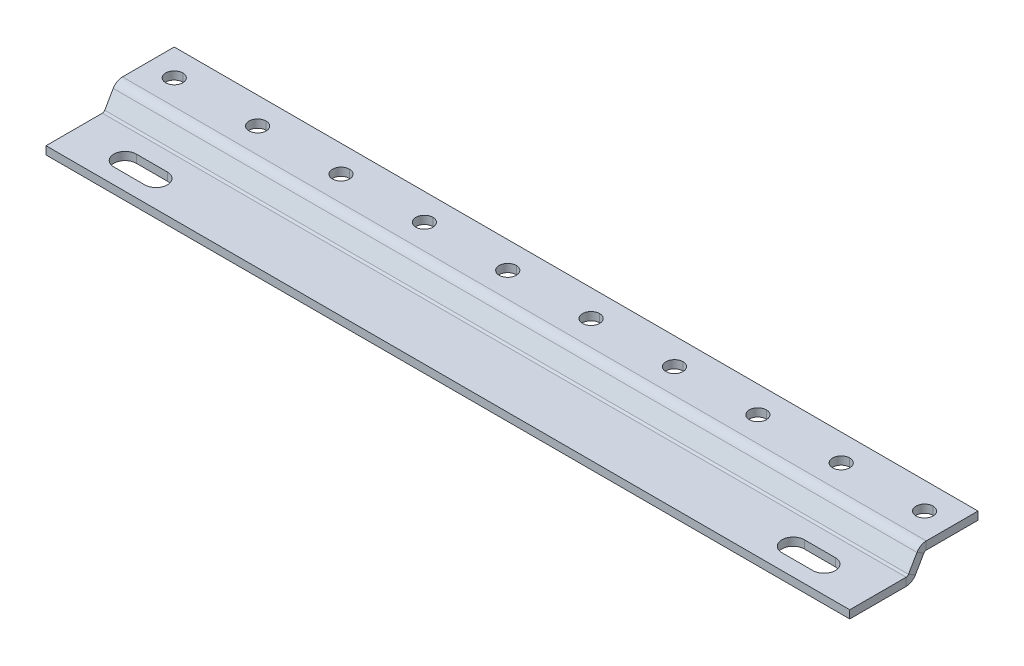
ISO-10303-21;
HEADER;
FILE_DESCRIPTION(('STEP AP214'),'2;1');
FILE_NAME('part.step','',(''),(''),'','','');
FILE_SCHEMA(('AUTOMOTIVE_DESIGN { 1 0 10303 214 1 1 1 1 }'));
ENDSEC;
DATA;
#1=APPLICATION_CONTEXT('core data for automotive mechanical design processes');
#2=APPLICATION_PROTOCOL_DEFINITION('international standard','automotive_design',2000,#1);
#3=PRODUCT_CONTEXT('',#1,'mechanical');
#4=PRODUCT('Part','Part','',(#3));
#5=PRODUCT_RELATED_PRODUCT_CATEGORY('part','',(#4));
#6=PRODUCT_DEFINITION_FORMATION('','',#4);
#7=PRODUCT_DEFINITION_CONTEXT('part definition',#1,'design');
#8=PRODUCT_DEFINITION('design','',#6,#7);
#9=PRODUCT_DEFINITION_SHAPE('','',#8);
#10=(LENGTH_UNIT() NAMED_UNIT(*) SI_UNIT(.MILLI.,.METRE.));
#11=(NAMED_UNIT(*) PLANE_ANGLE_UNIT() SI_UNIT($,.RADIAN.));
#12=(NAMED_UNIT(*) SI_UNIT($,.STERADIAN.) SOLID_ANGLE_UNIT());
#13=UNCERTAINTY_MEASURE_WITH_UNIT(LENGTH_MEASURE(1.E-05),#10,'distance_accuracy_value','');
#14=(GEOMETRIC_REPRESENTATION_CONTEXT(3) GLOBAL_UNCERTAINTY_ASSIGNED_CONTEXT((#13)) GLOBAL_UNIT_ASSIGNED_CONTEXT((#10,
#11,#12)) REPRESENTATION_CONTEXT('',''));
#15=CARTESIAN_POINT('',(0.,0.,0.));
#16=DIRECTION('',(0.,0.,1.));
#17=DIRECTION('',(1.,0.,0.));
#18=AXIS2_PLACEMENT_3D('',#15,#16,#17);
#19=CARTESIAN_POINT('',(134.8,-1.5,-2.9));
#20=DIRECTION('',(0.,0.,1.));
#21=DIRECTION('',(1.,0.,0.));
#22=AXIS2_PLACEMENT_3D('',#19,#20,#21);
#23=PLANE('',#22);
#24=DIRECTION('',(1.,0.,0.));
#25=VECTOR('',#24,1.);
#26=CARTESIAN_POINT('',(134.8,0.,-2.9));
#27=LINE('',#26,#25);
#28=CARTESIAN_POINT('',(134.8,0.,-2.9));
#29=VERTEX_POINT('',#28);
#30=CARTESIAN_POINT('',(140.6,0.,-2.9));
#31=VERTEX_POINT('',#30);
#32=EDGE_CURVE('E439',#29,#31,#27,.T.);
#33=ORIENTED_EDGE('',*,*,#32,.T.);
#34=DIRECTION('',(0.,1.,0.));
#35=VECTOR('',#34,1.);
#36=CARTESIAN_POINT('',(140.6,-1.5,-2.9));
#37=LINE('',#36,#35);
#38=CARTESIAN_POINT('',(140.6,-1.5,-2.9));
#39=VERTEX_POINT('',#38);
#40=EDGE_CURVE('E9',#39,#31,#37,.T.);
#41=ORIENTED_EDGE('',*,*,#40,.F.);
#42=DIRECTION('',(1.,0.,0.));
#43=VECTOR('',#42,1.);
#44=CARTESIAN_POINT('',(134.8,-1.5,-2.9));
#45=LINE('',#44,#43);
#46=CARTESIAN_POINT('',(134.8,-1.5,-2.9));
#47=VERTEX_POINT('',#46);
#48=EDGE_CURVE('E409',#47,#39,#45,.T.);
#49=ORIENTED_EDGE('',*,*,#48,.F.);
#50=DIRECTION('',(0.,1.,0.));
#51=VECTOR('',#50,1.);
#52=CARTESIAN_POINT('',(134.8,-1.5,-2.9));
#53=LINE('',#52,#51);
#54=EDGE_CURVE('E475',#47,#29,#53,.T.);
#55=ORIENTED_EDGE('',*,*,#54,.T.);
#56=EDGE_LOOP('',(#33,#41,#49,#55));
#57=FACE_BOUND('',#56,.T.);
#58=ADVANCED_FACE('F15',(#57),#23,.F.);
#59=CARTESIAN_POINT('',(140.6,-1.5,-5.));
#60=DIRECTION('',(0.,1.,0.));
#61=DIRECTION('',(0.,0.,1.));
#62=AXIS2_PLACEMENT_3D('',#59,#60,#61);
#63=CYLINDRICAL_SURFACE('',#62,2.1);
#64=CARTESIAN_POINT('',(140.6,0.,-5.));
#65=DIRECTION('',(0.,1.,0.));
#66=DIRECTION('',(0.,0.,1.));
#67=AXIS2_PLACEMENT_3D('',#64,#65,#66);
#68=CIRCLE('',#67,2.1);
#69=CARTESIAN_POINT('',(140.6,0.,-7.1));
#70=VERTEX_POINT('',#69);
#71=EDGE_CURVE('E435',#31,#70,#68,.T.);
#72=ORIENTED_EDGE('',*,*,#71,.T.);
#73=DIRECTION('',(0.,1.,0.));
#74=VECTOR('',#73,1.);
#75=CARTESIAN_POINT('',(140.6,-1.5,-7.1));
#76=LINE('',#75,#74);
#77=CARTESIAN_POINT('',(140.6,-1.5,-7.1));
#78=VERTEX_POINT('',#77);
#79=EDGE_CURVE('E18',#78,#70,#76,.T.);
#80=ORIENTED_EDGE('',*,*,#79,.F.);
#81=CARTESIAN_POINT('',(140.6,-1.5,-5.));
#82=DIRECTION('',(0.,1.,0.));
#83=DIRECTION('',(0.,0.,1.));
#84=AXIS2_PLACEMENT_3D('',#81,#82,#83);
#85=CIRCLE('',#84,2.1);
#86=EDGE_CURVE('E418',#39,#78,#85,.T.);
#87=ORIENTED_EDGE('',*,*,#86,.F.);
#88=ORIENTED_EDGE('',*,*,#40,.T.);
#89=EDGE_LOOP('',(#72,#80,#87,#88));
#90=FACE_BOUND('',#89,.T.);
#91=ADVANCED_FACE('F943',(#90),#63,.F.);
#92=CARTESIAN_POINT('',(134.8,-1.5,-7.1));
#93=DIRECTION('',(0.,0.,-1.));
#94=DIRECTION('',(-1.,0.,0.));
#95=AXIS2_PLACEMENT_3D('',#92,#93,#94);
#96=PLANE('',#95);
#97=DIRECTION('',(-1.,0.,0.));
#98=VECTOR('',#97,1.);
#99=CARTESIAN_POINT('',(134.8,0.,-7.1));
#100=LINE('',#99,#98);
#101=CARTESIAN_POINT('',(134.8,0.,-7.1));
#102=VERTEX_POINT('',#101);
#103=EDGE_CURVE('E440',#70,#102,#100,.T.);
#104=ORIENTED_EDGE('',*,*,#103,.T.);
#105=DIRECTION('',(0.,1.,0.));
#106=VECTOR('',#105,1.);
#107=CARTESIAN_POINT('',(134.8,-1.5,-7.1));
#108=LINE('',#107,#106);
#109=CARTESIAN_POINT('',(134.8,-1.5,-7.1));
#110=VERTEX_POINT('',#109);
#111=EDGE_CURVE('E782',#110,#102,#108,.T.);
#112=ORIENTED_EDGE('',*,*,#111,.F.);
#113=DIRECTION('',(-1.,0.,0.));
#114=VECTOR('',#113,1.);
#115=CARTESIAN_POINT('',(134.8,-1.5,-7.1));
#116=LINE('',#115,#114);
#117=EDGE_CURVE('E410',#78,#110,#116,.T.);
#118=ORIENTED_EDGE('',*,*,#117,.F.);
#119=ORIENTED_EDGE('',*,*,#79,.T.);
#120=EDGE_LOOP('',(#104,#112,#118,#119));
#121=FACE_BOUND('',#120,.T.);
#122=ADVANCED_FACE('F947',(#121),#96,.F.);
#123=CARTESIAN_POINT('',(134.8,-1.5,-5.));
#124=DIRECTION('',(0.,1.,0.));
#125=DIRECTION('',(0.,0.,1.));
#126=AXIS2_PLACEMENT_3D('',#123,#124,#125);
#127=CYLINDRICAL_SURFACE('',#126,2.1);
#128=CARTESIAN_POINT('',(134.8,0.,-5.));
#129=DIRECTION('',(0.,1.,0.));
#130=DIRECTION('',(0.,0.,1.));
#131=AXIS2_PLACEMENT_3D('',#128,#129,#130);
#132=CIRCLE('',#131,2.1);
#133=EDGE_CURVE('E747',#102,#29,#132,.T.);
#134=ORIENTED_EDGE('',*,*,#133,.T.);
#135=ORIENTED_EDGE('',*,*,#54,.F.);
#136=CARTESIAN_POINT('',(134.8,-1.5,-5.));
#137=DIRECTION('',(0.,1.,0.));
#138=DIRECTION('',(0.,0.,1.));
#139=AXIS2_PLACEMENT_3D('',#136,#137,#138);
#140=CIRCLE('',#139,2.1);
#141=EDGE_CURVE('E405',#110,#47,#140,.T.);
#142=ORIENTED_EDGE('',*,*,#141,.F.);
#143=ORIENTED_EDGE('',*,*,#111,.T.);
#144=EDGE_LOOP('',(#134,#135,#142,#143));
#145=FACE_BOUND('',#144,.T.);
#146=ADVANCED_FACE('F957',(#145),#127,.F.);
#147=CARTESIAN_POINT('',(9.8,-1.5,-2.89999999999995));
#148=DIRECTION('',(0.,0.,1.));
#149=DIRECTION('',(1.,0.,0.));
#150=AXIS2_PLACEMENT_3D('',#147,#148,#149);
#151=PLANE('',#150);
#152=DIRECTION('',(1.,0.,0.));
#153=VECTOR('',#152,1.);
#154=CARTESIAN_POINT('',(9.8,0.,-2.89999999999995));
#155=LINE('',#154,#153);
#156=CARTESIAN_POINT('',(9.8,0.,-2.89999999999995));
#157=VERTEX_POINT('',#156);
#158=CARTESIAN_POINT('',(15.6,0.,-2.9));
#159=VERTEX_POINT('',#158);
#160=EDGE_CURVE('E708',#157,#159,#155,.T.);
#161=ORIENTED_EDGE('',*,*,#160,.T.);
#162=DIRECTION('',(0.,1.,0.));
#163=VECTOR('',#162,1.);
#164=CARTESIAN_POINT('',(15.6,-1.5,-2.9));
#165=LINE('',#164,#163);
#166=CARTESIAN_POINT('',(15.6,-1.5,-2.89999999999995));
#167=VERTEX_POINT('',#166);
#168=EDGE_CURVE('E34',#167,#159,#165,.T.);
#169=ORIENTED_EDGE('',*,*,#168,.F.);
#170=DIRECTION('',(1.,0.,0.));
#171=VECTOR('',#170,1.);
#172=CARTESIAN_POINT('',(9.8,-1.5,-2.89999999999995));
#173=LINE('',#172,#171);
#174=CARTESIAN_POINT('',(9.8,-1.5,-2.89999999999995));
#175=VERTEX_POINT('',#174);
#176=EDGE_CURVE('E740',#175,#167,#173,.T.);
#177=ORIENTED_EDGE('',*,*,#176,.F.);
#178=DIRECTION('',(0.,1.,0.));
#179=VECTOR('',#178,1.);
#180=CARTESIAN_POINT('',(9.8,-1.5,-2.89999999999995));
#181=LINE('',#180,#179);
#182=EDGE_CURVE('E43',#175,#157,#181,.T.);
#183=ORIENTED_EDGE('',*,*,#182,.T.);
#184=EDGE_LOOP('',(#161,#169,#177,#183));
#185=FACE_BOUND('',#184,.T.);
#186=ADVANCED_FACE('F959',(#185),#151,.F.);
#187=CARTESIAN_POINT('',(15.6,-1.5,-5.0000000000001));
#188=DIRECTION('',(0.,1.,0.));
#189=DIRECTION('',(0.,0.,1.));
#190=AXIS2_PLACEMENT_3D('',#187,#188,#189);
#191=CYLINDRICAL_SURFACE('',#190,2.10000000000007);
#192=CARTESIAN_POINT('',(15.6,0.,-5.0000000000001));
#193=DIRECTION('',(0.,1.,0.));
#194=DIRECTION('',(0.,0.,1.));
#195=AXIS2_PLACEMENT_3D('',#192,#193,#194);
#196=CIRCLE('',#195,2.10000000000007);
#197=CARTESIAN_POINT('',(15.6,0.,-7.1000000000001));
#198=VERTEX_POINT('',#197);
#199=EDGE_CURVE('E700',#159,#198,#196,.T.);
#200=ORIENTED_EDGE('',*,*,#199,.T.);
#201=DIRECTION('',(0.,1.,0.));
#202=VECTOR('',#201,1.);
#203=CARTESIAN_POINT('',(15.6,-1.5,-7.1000000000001));
#204=LINE('',#203,#202);
#205=CARTESIAN_POINT('',(15.6,-1.5,-7.1000000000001));
#206=VERTEX_POINT('',#205);
#207=EDGE_CURVE('E476',#206,#198,#204,.T.);
#208=ORIENTED_EDGE('',*,*,#207,.F.);
#209=CARTESIAN_POINT('',(15.6,-1.5,-5.0000000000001));
#210=DIRECTION('',(0.,1.,0.));
#211=DIRECTION('',(0.,0.,1.));
#212=AXIS2_PLACEMENT_3D('',#209,#210,#211);
#213=CIRCLE('',#212,2.10000000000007);
#214=EDGE_CURVE('E744',#167,#206,#213,.T.);
#215=ORIENTED_EDGE('',*,*,#214,.F.);
#216=ORIENTED_EDGE('',*,*,#168,.T.);
#217=EDGE_LOOP('',(#200,#208,#215,#216));
#218=FACE_BOUND('',#217,.T.);
#219=ADVANCED_FACE('F964',(#218),#191,.F.);
#220=CARTESIAN_POINT('',(9.8,-1.5,-7.1000000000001));
#221=DIRECTION('',(0.,0.,-1.));
#222=DIRECTION('',(-1.,0.,0.));
#223=AXIS2_PLACEMENT_3D('',#220,#221,#222);
#224=PLANE('',#223);
#225=DIRECTION('',(-1.,0.,0.));
#226=VECTOR('',#225,1.);
#227=CARTESIAN_POINT('',(9.8,0.,-7.1000000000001));
#228=LINE('',#227,#226);
#229=CARTESIAN_POINT('',(9.8,0.,-7.1000000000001));
#230=VERTEX_POINT('',#229);
#231=EDGE_CURVE('E568',#198,#230,#228,.T.);
#232=ORIENTED_EDGE('',*,*,#231,.T.);
#233=DIRECTION('',(0.,1.,0.));
#234=VECTOR('',#233,1.);
#235=CARTESIAN_POINT('',(9.8,-1.5,-7.1000000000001));
#236=LINE('',#235,#234);
#237=CARTESIAN_POINT('',(9.8,-1.5,-7.1000000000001));
#238=VERTEX_POINT('',#237);
#239=EDGE_CURVE('E497',#238,#230,#236,.T.);
#240=ORIENTED_EDGE('',*,*,#239,.F.);
#241=DIRECTION('',(-1.,0.,0.));
#242=VECTOR('',#241,1.);
#243=CARTESIAN_POINT('',(9.8,-1.5,-7.1000000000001));
#244=LINE('',#243,#242);
#245=EDGE_CURVE('E503',#206,#238,#244,.T.);
#246=ORIENTED_EDGE('',*,*,#245,.F.);
#247=ORIENTED_EDGE('',*,*,#207,.T.);
#248=EDGE_LOOP('',(#232,#240,#246,#247));
#249=FACE_BOUND('',#248,.T.);
#250=ADVANCED_FACE('F971',(#249),#224,.F.);
#251=CARTESIAN_POINT('',(9.8,-1.5,-5.0000000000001));
#252=DIRECTION('',(0.,1.,0.));
#253=DIRECTION('',(0.,0.,1.));
#254=AXIS2_PLACEMENT_3D('',#251,#252,#253);
#255=CYLINDRICAL_SURFACE('',#254,2.10000000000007);
#256=CARTESIAN_POINT('',(9.8,0.,-5.0000000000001));
#257=DIRECTION('',(0.,1.,0.));
#258=DIRECTION('',(0.,0.,1.));
#259=AXIS2_PLACEMENT_3D('',#256,#257,#258);
#260=CIRCLE('',#259,2.10000000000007);
#261=EDGE_CURVE('E565',#230,#157,#260,.T.);
#262=ORIENTED_EDGE('',*,*,#261,.T.);
#263=ORIENTED_EDGE('',*,*,#182,.F.);
#264=CARTESIAN_POINT('',(9.8,-1.5,-5.0000000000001));
#265=DIRECTION('',(0.,1.,0.));
#266=DIRECTION('',(0.,0.,1.));
#267=AXIS2_PLACEMENT_3D('',#264,#265,#266);
#268=CIRCLE('',#267,2.10000000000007);
#269=EDGE_CURVE('E517',#238,#175,#268,.T.);
#270=ORIENTED_EDGE('',*,*,#269,.F.);
#271=ORIENTED_EDGE('',*,*,#239,.T.);
#272=EDGE_LOOP('',(#262,#263,#270,#271));
#273=FACE_BOUND('',#272,.T.);
#274=ADVANCED_FACE('F973',(#273),#255,.F.);
#275=CARTESIAN_POINT('',(145.4,4.,-19.));
#276=DIRECTION('',(0.,1.,0.));
#277=DIRECTION('',(0.,0.,1.));
#278=AXIS2_PLACEMENT_3D('',#275,#276,#277);
#279=CYLINDRICAL_SURFACE('',#278,1.6);
#280=DIRECTION('',(0.,1.,0.));
#281=VECTOR('',#280,1.);
#282=CARTESIAN_POINT('',(145.4,4.,-20.6));
#283=LINE('',#282,#281);
#284=CARTESIAN_POINT('',(145.4,2.5,-20.6));
#285=VERTEX_POINT('',#284);
#286=CARTESIAN_POINT('',(145.4,4.,-20.6));
#287=VERTEX_POINT('',#286);
#288=EDGE_CURVE('E828',#285,#287,#283,.T.);
#289=ORIENTED_EDGE('',*,*,#288,.F.);
#290=CARTESIAN_POINT('',(145.4,2.5,-19.));
#291=DIRECTION('',(0.,1.,0.));
#292=DIRECTION('',(0.,0.,1.));
#293=AXIS2_PLACEMENT_3D('',#290,#291,#292);
#294=CIRCLE('',#293,1.6);
#295=CARTESIAN_POINT('',(145.4,2.5,-17.4));
#296=VERTEX_POINT('',#295);
#297=EDGE_CURVE('E468',#296,#285,#294,.T.);
#298=ORIENTED_EDGE('',*,*,#297,.F.);
#299=DIRECTION('',(0.,1.,0.));
#300=VECTOR('',#299,1.);
#301=CARTESIAN_POINT('',(145.4,4.,-17.4));
#302=LINE('',#301,#300);
#303=CARTESIAN_POINT('',(145.4,4.,-17.4));
#304=VERTEX_POINT('',#303);
#305=EDGE_CURVE('E799',#296,#304,#302,.T.);
#306=ORIENTED_EDGE('',*,*,#305,.T.);
#307=CARTESIAN_POINT('',(145.4,4.,-19.));
#308=DIRECTION('',(0.,1.,0.));
#309=DIRECTION('',(0.,0.,1.));
#310=AXIS2_PLACEMENT_3D('',#307,#308,#309);
#311=CIRCLE('',#310,1.6);
#312=EDGE_CURVE('E543',#304,#287,#311,.T.);
#313=ORIENTED_EDGE('',*,*,#312,.T.);
#314=EDGE_LOOP('',(#289,#298,#306,#313));
#315=FACE_BOUND('',#314,.T.);
#316=ADVANCED_FACE('F976',(#315),#279,.F.);
#317=CARTESIAN_POINT('',(129.8,4.,-19.));
#318=DIRECTION('',(0.,1.,0.));
#319=DIRECTION('',(0.,0.,1.));
#320=AXIS2_PLACEMENT_3D('',#317,#318,#319);
#321=CYLINDRICAL_SURFACE('',#320,1.6);
#322=DIRECTION('',(0.,1.,0.));
#323=VECTOR('',#322,1.);
#324=CARTESIAN_POINT('',(129.8,4.,-20.6));
#325=LINE('',#324,#323);
#326=CARTESIAN_POINT('',(129.8,2.5,-20.6));
#327=VERTEX_POINT('',#326);
#328=CARTESIAN_POINT('',(129.8,4.,-20.6));
#329=VERTEX_POINT('',#328);
#330=EDGE_CURVE('E388',#327,#329,#325,.T.);
#331=ORIENTED_EDGE('',*,*,#330,.F.);
#332=CARTESIAN_POINT('',(129.8,2.5,-19.));
#333=DIRECTION('',(0.,1.,0.));
#334=DIRECTION('',(0.,0.,1.));
#335=AXIS2_PLACEMENT_3D('',#332,#333,#334);
#336=CIRCLE('',#335,1.6);
#337=CARTESIAN_POINT('',(129.8,2.5,-17.4));
#338=VERTEX_POINT('',#337);
#339=EDGE_CURVE('E654',#338,#327,#336,.T.);
#340=ORIENTED_EDGE('',*,*,#339,.F.);
#341=DIRECTION('',(0.,1.,0.));
#342=VECTOR('',#341,1.);
#343=CARTESIAN_POINT('',(129.8,4.,-17.4));
#344=LINE('',#343,#342);
#345=CARTESIAN_POINT('',(129.8,4.,-17.4));
#346=VERTEX_POINT('',#345);
#347=EDGE_CURVE('E395',#338,#346,#344,.T.);
#348=ORIENTED_EDGE('',*,*,#347,.T.);
#349=CARTESIAN_POINT('',(129.8,4.,-19.));
#350=DIRECTION('',(0.,1.,0.));
#351=DIRECTION('',(0.,0.,1.));
#352=AXIS2_PLACEMENT_3D('',#349,#350,#351);
#353=CIRCLE('',#352,1.6);
#354=EDGE_CURVE('E735',#346,#329,#353,.T.);
#355=ORIENTED_EDGE('',*,*,#354,.T.);
#356=EDGE_LOOP('',(#331,#340,#348,#355));
#357=FACE_BOUND('',#356,.T.);
#358=ADVANCED_FACE('F979',(#357),#321,.F.);
#359=CARTESIAN_POINT('',(114.2,4.,-19.));
#360=DIRECTION('',(0.,1.,0.));
#361=DIRECTION('',(0.,0.,1.));
#362=AXIS2_PLACEMENT_3D('',#359,#360,#361);
#363=CYLINDRICAL_SURFACE('',#362,1.6);
#364=DIRECTION('',(0.,1.,0.));
#365=VECTOR('',#364,1.);
#366=CARTESIAN_POINT('',(114.2,4.,-20.6));
#367=LINE('',#366,#365);
#368=CARTESIAN_POINT('',(114.2,2.5,-20.6));
#369=VERTEX_POINT('',#368);
#370=CARTESIAN_POINT('',(114.2,4.,-20.6));
#371=VERTEX_POINT('',#370);
#372=EDGE_CURVE('E404',#369,#371,#367,.T.);
#373=ORIENTED_EDGE('',*,*,#372,.F.);
#374=CARTESIAN_POINT('',(114.2,2.5,-19.));
#375=DIRECTION('',(0.,1.,0.));
#376=DIRECTION('',(0.,0.,1.));
#377=AXIS2_PLACEMENT_3D('',#374,#375,#376);
#378=CIRCLE('',#377,1.6);
#379=CARTESIAN_POINT('',(114.2,2.5,-17.4));
#380=VERTEX_POINT('',#379);
#381=EDGE_CURVE('E657',#380,#369,#378,.T.);
#382=ORIENTED_EDGE('',*,*,#381,.F.);
#383=DIRECTION('',(0.,1.,0.));
#384=VECTOR('',#383,1.);
#385=CARTESIAN_POINT('',(114.2,4.,-17.4));
#386=LINE('',#385,#384);
#387=CARTESIAN_POINT('',(114.2,4.,-17.4));
#388=VERTEX_POINT('',#387);
#389=EDGE_CURVE('E422',#380,#388,#386,.T.);
#390=ORIENTED_EDGE('',*,*,#389,.T.);
#391=CARTESIAN_POINT('',(114.2,4.,-19.));
#392=DIRECTION('',(0.,1.,0.));
#393=DIRECTION('',(0.,0.,1.));
#394=AXIS2_PLACEMENT_3D('',#391,#392,#393);
#395=CIRCLE('',#394,1.6);
#396=EDGE_CURVE('E364',#388,#371,#395,.T.);
#397=ORIENTED_EDGE('',*,*,#396,.T.);
#398=EDGE_LOOP('',(#373,#382,#390,#397));
#399=FACE_BOUND('',#398,.T.);
#400=ADVANCED_FACE('F983',(#399),#363,.F.);
#401=CARTESIAN_POINT('',(98.6,4.,-19.));
#402=DIRECTION('',(0.,1.,0.));
#403=DIRECTION('',(0.,0.,1.));
#404=AXIS2_PLACEMENT_3D('',#401,#402,#403);
#405=CYLINDRICAL_SURFACE('',#404,1.6);
#406=DIRECTION('',(0.,1.,0.));
#407=VECTOR('',#406,1.);
#408=CARTESIAN_POINT('',(98.6,4.,-20.6));
#409=LINE('',#408,#407);
#410=CARTESIAN_POINT('',(98.6,2.5,-20.6));
#411=VERTEX_POINT('',#410);
#412=CARTESIAN_POINT('',(98.6,4.,-20.6));
#413=VERTEX_POINT('',#412);
#414=EDGE_CURVE('E378',#411,#413,#409,.T.);
#415=ORIENTED_EDGE('',*,*,#414,.F.);
#416=CARTESIAN_POINT('',(98.6,2.5,-19.));
#417=DIRECTION('',(0.,1.,0.));
#418=DIRECTION('',(0.,0.,1.));
#419=AXIS2_PLACEMENT_3D('',#416,#417,#418);
#420=CIRCLE('',#419,1.6);
#421=CARTESIAN_POINT('',(98.6,2.5,-17.4));
#422=VERTEX_POINT('',#421);
#423=EDGE_CURVE('E370',#422,#411,#420,.T.);
#424=ORIENTED_EDGE('',*,*,#423,.F.);
#425=DIRECTION('',(0.,1.,0.));
#426=VECTOR('',#425,1.);
#427=CARTESIAN_POINT('',(98.6,4.,-17.4));
#428=LINE('',#427,#426);
#429=CARTESIAN_POINT('',(98.6,4.,-17.4));
#430=VERTEX_POINT('',#429);
#431=EDGE_CURVE('E368',#422,#430,#428,.T.);
#432=ORIENTED_EDGE('',*,*,#431,.T.);
#433=CARTESIAN_POINT('',(98.6,4.,-19.));
#434=DIRECTION('',(0.,1.,0.));
#435=DIRECTION('',(0.,0.,1.));
#436=AXIS2_PLACEMENT_3D('',#433,#434,#435);
#437=CIRCLE('',#436,1.6);
#438=EDGE_CURVE('E354',#430,#413,#437,.T.);
#439=ORIENTED_EDGE('',*,*,#438,.T.);
#440=EDGE_LOOP('',(#415,#424,#432,#439));
#441=FACE_BOUND('',#440,.T.);
#442=ADVANCED_FACE('F369',(#441),#405,.F.);
#443=CARTESIAN_POINT('',(83.,4.,-19.));
#444=DIRECTION('',(0.,1.,0.));
#445=DIRECTION('',(0.,0.,1.));
#446=AXIS2_PLACEMENT_3D('',#443,#444,#445);
#447=CYLINDRICAL_SURFACE('',#446,1.6);
#448=DIRECTION('',(0.,1.,0.));
#449=VECTOR('',#448,1.);
#450=CARTESIAN_POINT('',(83.,4.,-20.6));
#451=LINE('',#450,#449);
#452=CARTESIAN_POINT('',(83.,2.5,-20.6));
#453=VERTEX_POINT('',#452);
#454=CARTESIAN_POINT('',(83.,4.,-20.6));
#455=VERTEX_POINT('',#454);
#456=EDGE_CURVE('E434',#453,#455,#451,.T.);
#457=ORIENTED_EDGE('',*,*,#456,.F.);
#458=CARTESIAN_POINT('',(83.,2.5,-19.));
#459=DIRECTION('',(0.,1.,0.));
#460=DIRECTION('',(0.,0.,1.));
#461=AXIS2_PLACEMENT_3D('',#458,#459,#460);
#462=CIRCLE('',#461,1.6);
#463=CARTESIAN_POINT('',(83.,2.5,-17.4));
#464=VERTEX_POINT('',#463);
#465=EDGE_CURVE('E559',#464,#453,#462,.T.);
#466=ORIENTED_EDGE('',*,*,#465,.F.);
#467=DIRECTION('',(0.,1.,0.));
#468=VECTOR('',#467,1.);
#469=CARTESIAN_POINT('',(83.,4.,-17.4));
#470=LINE('',#469,#468);
#471=CARTESIAN_POINT('',(83.,4.,-17.4));
#472=VERTEX_POINT('',#471);
#473=EDGE_CURVE('E454',#464,#472,#470,.T.);
#474=ORIENTED_EDGE('',*,*,#473,.T.);
#475=CARTESIAN_POINT('',(83.,4.,-19.));
#476=DIRECTION('',(0.,1.,0.));
#477=DIRECTION('',(0.,0.,1.));
#478=AXIS2_PLACEMENT_3D('',#475,#476,#477);
#479=CIRCLE('',#478,1.6);
#480=EDGE_CURVE('E365',#472,#455,#479,.T.);
#481=ORIENTED_EDGE('',*,*,#480,.T.);
#482=EDGE_LOOP('',(#457,#466,#474,#481));
#483=FACE_BOUND('',#482,.T.);
#484=ADVANCED_FACE('F991',(#483),#447,.F.);
#485=CARTESIAN_POINT('',(67.4,4.,-19.));
#486=DIRECTION('',(0.,1.,0.));
#487=DIRECTION('',(0.,0.,1.));
#488=AXIS2_PLACEMENT_3D('',#485,#486,#487);
#489=CYLINDRICAL_SURFACE('',#488,1.6);
#490=DIRECTION('',(0.,1.,0.));
#491=VECTOR('',#490,1.);
#492=CARTESIAN_POINT('',(67.4,4.,-20.6));
#493=LINE('',#492,#491);
#494=CARTESIAN_POINT('',(67.4,2.5,-20.6));
#495=VERTEX_POINT('',#494);
#496=CARTESIAN_POINT('',(67.4,4.,-20.6));
#497=VERTEX_POINT('',#496);
#498=EDGE_CURVE('E459',#495,#497,#493,.T.);
#499=ORIENTED_EDGE('',*,*,#498,.F.);
#500=CARTESIAN_POINT('',(67.4,2.5,-19.));
#501=DIRECTION('',(0.,1.,0.));
#502=DIRECTION('',(0.,0.,1.));
#503=AXIS2_PLACEMENT_3D('',#500,#501,#502);
#504=CIRCLE('',#503,1.6);
#505=CARTESIAN_POINT('',(67.4,2.5,-17.4));
#506=VERTEX_POINT('',#505);
#507=EDGE_CURVE('E556',#506,#495,#504,.T.);
#508=ORIENTED_EDGE('',*,*,#507,.F.);
#509=DIRECTION('',(0.,1.,0.));
#510=VECTOR('',#509,1.);
#511=CARTESIAN_POINT('',(67.4,4.,-17.4));
#512=LINE('',#511,#510);
#513=CARTESIAN_POINT('',(67.4,4.,-17.4));
#514=VERTEX_POINT('',#513);
#515=EDGE_CURVE('E472',#506,#514,#512,.T.);
#516=ORIENTED_EDGE('',*,*,#515,.T.);
#517=CARTESIAN_POINT('',(67.4,4.,-19.));
#518=DIRECTION('',(0.,1.,0.));
#519=DIRECTION('',(0.,0.,1.));
#520=AXIS2_PLACEMENT_3D('',#517,#518,#519);
#521=CIRCLE('',#520,1.6);
#522=EDGE_CURVE('E491',#514,#497,#521,.T.);
#523=ORIENTED_EDGE('',*,*,#522,.T.);
#524=EDGE_LOOP('',(#499,#508,#516,#523));
#525=FACE_BOUND('',#524,.T.);
#526=ADVANCED_FACE('F843',(#525),#489,.F.);
#527=CARTESIAN_POINT('',(51.8,4.,-19.));
#528=DIRECTION('',(0.,1.,0.));
#529=DIRECTION('',(0.,0.,1.));
#530=AXIS2_PLACEMENT_3D('',#527,#528,#529);
#531=CYLINDRICAL_SURFACE('',#530,1.6);
#532=DIRECTION('',(0.,1.,0.));
#533=VECTOR('',#532,1.);
#534=CARTESIAN_POINT('',(51.8,4.,-20.6));
#535=LINE('',#534,#533);
#536=CARTESIAN_POINT('',(51.8,2.5,-20.6));
#537=VERTEX_POINT('',#536);
#538=CARTESIAN_POINT('',(51.8,4.,-20.6));
#539=VERTEX_POINT('',#538);
#540=EDGE_CURVE('E496',#537,#539,#535,.T.);
#541=ORIENTED_EDGE('',*,*,#540,.F.);
#542=CARTESIAN_POINT('',(51.8,2.5,-19.));
#543=DIRECTION('',(0.,1.,0.));
#544=DIRECTION('',(0.,0.,1.));
#545=AXIS2_PLACEMENT_3D('',#542,#543,#544);
#546=CIRCLE('',#545,1.6);
#547=CARTESIAN_POINT('',(51.8,2.5,-17.4));
#548=VERTEX_POINT('',#547);
#549=EDGE_CURVE('E429',#548,#537,#546,.T.);
#550=ORIENTED_EDGE('',*,*,#549,.F.);
#551=DIRECTION('',(0.,1.,0.));
#552=VECTOR('',#551,1.);
#553=CARTESIAN_POINT('',(51.8,4.,-17.4));
#554=LINE('',#553,#552);
#555=CARTESIAN_POINT('',(51.8,4.,-17.4));
#556=VERTEX_POINT('',#555);
#557=EDGE_CURVE('E525',#548,#556,#554,.T.);
#558=ORIENTED_EDGE('',*,*,#557,.T.);
#559=CARTESIAN_POINT('',(51.8,4.,-19.));
#560=DIRECTION('',(0.,1.,0.));
#561=DIRECTION('',(0.,0.,1.));
#562=AXIS2_PLACEMENT_3D('',#559,#560,#561);
#563=CIRCLE('',#562,1.6);
#564=EDGE_CURVE('E488',#556,#539,#563,.T.);
#565=ORIENTED_EDGE('',*,*,#564,.T.);
#566=EDGE_LOOP('',(#541,#550,#558,#565));
#567=FACE_BOUND('',#566,.T.);
#568=ADVANCED_FACE('F990',(#567),#531,.F.);
#569=CARTESIAN_POINT('',(36.2,4.,-19.));
#570=DIRECTION('',(0.,1.,0.));
#571=DIRECTION('',(0.,0.,1.));
#572=AXIS2_PLACEMENT_3D('',#569,#570,#571);
#573=CYLINDRICAL_SURFACE('',#572,1.6);
#574=DIRECTION('',(0.,1.,0.));
#575=VECTOR('',#574,1.);
#576=CARTESIAN_POINT('',(36.2,4.,-20.6));
#577=LINE('',#576,#575);
#578=CARTESIAN_POINT('',(36.2,2.5,-20.6));
#579=VERTEX_POINT('',#578);
#580=CARTESIAN_POINT('',(36.2,4.,-20.6));
#581=VERTEX_POINT('',#580);
#582=EDGE_CURVE('E538',#579,#581,#577,.T.);
#583=ORIENTED_EDGE('',*,*,#582,.F.);
#584=CARTESIAN_POINT('',(36.2,2.5,-19.));
#585=DIRECTION('',(0.,1.,0.));
#586=DIRECTION('',(0.,0.,1.));
#587=AXIS2_PLACEMENT_3D('',#584,#585,#586);
#588=CIRCLE('',#587,1.6);
#589=CARTESIAN_POINT('',(36.2,2.5,-17.4));
#590=VERTEX_POINT('',#589);
#591=EDGE_CURVE('E426',#590,#579,#588,.T.);
#592=ORIENTED_EDGE('',*,*,#591,.F.);
#593=DIRECTION('',(0.,1.,0.));
#594=VECTOR('',#593,1.);
#595=CARTESIAN_POINT('',(36.2,4.,-17.4));
#596=LINE('',#595,#594);
#597=CARTESIAN_POINT('',(36.2,4.,-17.4));
#598=VERTEX_POINT('',#597);
#599=EDGE_CURVE('E555',#590,#598,#596,.T.);
#600=ORIENTED_EDGE('',*,*,#599,.T.);
#601=CARTESIAN_POINT('',(36.2,4.,-19.));
#602=DIRECTION('',(0.,1.,0.));
#603=DIRECTION('',(0.,0.,1.));
#604=AXIS2_PLACEMENT_3D('',#601,#602,#603);
#605=CIRCLE('',#604,1.6);
#606=EDGE_CURVE('E492',#598,#581,#605,.T.);
#607=ORIENTED_EDGE('',*,*,#606,.T.);
#608=EDGE_LOOP('',(#583,#592,#600,#607));
#609=FACE_BOUND('',#608,.T.);
#610=ADVANCED_FACE('F994',(#609),#573,.F.);
#611=CARTESIAN_POINT('',(20.6,4.,-19.));
#612=DIRECTION('',(0.,1.,0.));
#613=DIRECTION('',(0.,0.,1.));
#614=AXIS2_PLACEMENT_3D('',#611,#612,#613);
#615=CYLINDRICAL_SURFACE('',#614,1.6);
#616=DIRECTION('',(0.,1.,0.));
#617=VECTOR('',#616,1.);
#618=CARTESIAN_POINT('',(20.6,4.,-20.6));
#619=LINE('',#618,#617);
#620=CARTESIAN_POINT('',(20.6,2.5,-20.6));
#621=VERTEX_POINT('',#620);
#622=CARTESIAN_POINT('',(20.6,4.,-20.6));
#623=VERTEX_POINT('',#622);
#624=EDGE_CURVE('E564',#621,#623,#619,.T.);
#625=ORIENTED_EDGE('',*,*,#624,.F.);
#626=CARTESIAN_POINT('',(20.6,2.5,-19.));
#627=DIRECTION('',(0.,1.,0.));
#628=DIRECTION('',(0.,0.,1.));
#629=AXIS2_PLACEMENT_3D('',#626,#627,#628);
#630=CIRCLE('',#629,1.6);
#631=CARTESIAN_POINT('',(20.6,2.5,-17.4));
#632=VERTEX_POINT('',#631);
#633=EDGE_CURVE('E759',#632,#621,#630,.T.);
#634=ORIENTED_EDGE('',*,*,#633,.F.);
#635=DIRECTION('',(0.,1.,0.));
#636=VECTOR('',#635,1.);
#637=CARTESIAN_POINT('',(20.6,4.,-17.4));
#638=LINE('',#637,#636);
#639=CARTESIAN_POINT('',(20.6,4.,-17.4));
#640=VERTEX_POINT('',#639);
#641=EDGE_CURVE('E581',#632,#640,#638,.T.);
#642=ORIENTED_EDGE('',*,*,#641,.T.);
#643=CARTESIAN_POINT('',(20.6,4.,-19.));
#644=DIRECTION('',(0.,1.,0.));
#645=DIRECTION('',(0.,0.,1.));
#646=AXIS2_PLACEMENT_3D('',#643,#644,#645);
#647=CIRCLE('',#646,1.6);
#648=EDGE_CURVE('E658',#640,#623,#647,.T.);
#649=ORIENTED_EDGE('',*,*,#648,.T.);
#650=EDGE_LOOP('',(#625,#634,#642,#649));
#651=FACE_BOUND('',#650,.T.);
#652=ADVANCED_FACE('F998',(#651),#615,.F.);
#653=CARTESIAN_POINT('',(5.,4.,-19.));
#654=DIRECTION('',(0.,1.,0.));
#655=DIRECTION('',(0.,0.,1.));
#656=AXIS2_PLACEMENT_3D('',#653,#654,#655);
#657=CYLINDRICAL_SURFACE('',#656,1.6);
#658=DIRECTION('',(0.,1.,0.));
#659=VECTOR('',#658,1.);
#660=CARTESIAN_POINT('',(5.,4.,-20.6));
#661=LINE('',#660,#659);
#662=CARTESIAN_POINT('',(5.,2.5,-20.6));
#663=VERTEX_POINT('',#662);
#664=CARTESIAN_POINT('',(5.,4.,-20.6));
#665=VERTEX_POINT('',#664);
#666=EDGE_CURVE('E589',#663,#665,#661,.T.);
#667=ORIENTED_EDGE('',*,*,#666,.F.);
#668=CARTESIAN_POINT('',(5.,2.5,-19.));
#669=DIRECTION('',(0.,1.,0.));
#670=DIRECTION('',(0.,0.,1.));
#671=AXIS2_PLACEMENT_3D('',#668,#669,#670);
#672=CIRCLE('',#671,1.6);
#673=CARTESIAN_POINT('',(5.,2.5,-17.4));
#674=VERTEX_POINT('',#673);
#675=EDGE_CURVE('E430',#674,#663,#672,.T.);
#676=ORIENTED_EDGE('',*,*,#675,.F.);
#677=DIRECTION('',(0.,1.,0.));
#678=VECTOR('',#677,1.);
#679=CARTESIAN_POINT('',(5.,4.,-17.4));
#680=LINE('',#679,#678);
#681=CARTESIAN_POINT('',(5.,4.,-17.4));
#682=VERTEX_POINT('',#681);
#683=EDGE_CURVE('E597',#674,#682,#680,.T.);
#684=ORIENTED_EDGE('',*,*,#683,.T.);
#685=CARTESIAN_POINT('',(5.,4.,-19.));
#686=DIRECTION('',(0.,1.,0.));
#687=DIRECTION('',(0.,0.,1.));
#688=AXIS2_PLACEMENT_3D('',#685,#686,#687);
#689=CIRCLE('',#688,1.6);
#690=EDGE_CURVE('E661',#682,#665,#689,.T.);
#691=ORIENTED_EDGE('',*,*,#690,.T.);
#692=EDGE_LOOP('',(#667,#676,#684,#691));
#693=FACE_BOUND('',#692,.T.);
#694=ADVANCED_FACE('F1002',(#693),#657,.F.);
#695=CARTESIAN_POINT('',(150.4,-0.75,-12.1443375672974));
#696=DIRECTION('',(0.,0.5,0.86602540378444));
#697=DIRECTION('',(1.,0.,0.));
#698=AXIS2_PLACEMENT_3D('',#695,#696,#697);
#699=PLANE('',#698);
#700=DIRECTION('',(0.,0.86602540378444,-0.5));
#701=VECTOR('',#700,1.);
#702=CARTESIAN_POINT('',(150.4,-0.75,-12.1443375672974));
#703=LINE('',#702,#701);
#704=CARTESIAN_POINT('',(150.4,-0.5,-12.2886751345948));
#705=VERTEX_POINT('',#704);
#706=CARTESIAN_POINT('',(150.4,2.25,-13.8763883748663));
#707=VERTEX_POINT('',#706);
#708=EDGE_CURVE('E390',#705,#707,#703,.T.);
#709=ORIENTED_EDGE('',*,*,#708,.F.);
#710=DIRECTION('',(1.,0.,0.));
#711=VECTOR('',#710,1.);
#712=CARTESIAN_POINT('',(150.4,-0.5,-12.2886751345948));
#713=LINE('',#712,#711);
#714=CARTESIAN_POINT('',(0.,-0.5,-12.2886751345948));
#715=VERTEX_POINT('',#714);
#716=EDGE_CURVE('E467',#715,#705,#713,.T.);
#717=ORIENTED_EDGE('',*,*,#716,.F.);
#718=DIRECTION('',(0.,0.86602540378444,-0.5));
#719=VECTOR('',#718,1.);
#720=CARTESIAN_POINT('',(0.,-0.75,-12.1443375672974));
#721=LINE('',#720,#719);
#722=CARTESIAN_POINT('',(0.,2.25,-13.8763883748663));
#723=VERTEX_POINT('',#722);
#724=EDGE_CURVE('E653',#715,#723,#721,.T.);
#725=ORIENTED_EDGE('',*,*,#724,.T.);
#726=DIRECTION('',(-1.,0.,0.));
#727=VECTOR('',#726,1.);
#728=CARTESIAN_POINT('',(150.4,2.25,-13.8763883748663));
#729=LINE('',#728,#727);
#730=EDGE_CURVE('E714',#707,#723,#729,.T.);
#731=ORIENTED_EDGE('',*,*,#730,.F.);
#732=EDGE_LOOP('',(#709,#717,#725,#731));
#733=FACE_BOUND('',#732,.T.);
#734=ADVANCED_FACE('F892',(#733),#699,.F.);
#735=CARTESIAN_POINT('',(150.4,-1.5,0.));
#736=DIRECTION('',(0.,1.,0.));
#737=DIRECTION('',(1.,0.,0.));
#738=AXIS2_PLACEMENT_3D('',#735,#736,#737);
#739=PLANE('',#738);
#740=ORIENTED_EDGE('',*,*,#245,.T.);
#741=ORIENTED_EDGE('',*,*,#269,.T.);
#742=ORIENTED_EDGE('',*,*,#176,.T.);
#743=ORIENTED_EDGE('',*,*,#214,.T.);
#744=EDGE_LOOP('',(#740,#741,#742,#743));
#745=FACE_BOUND('',#744,.T.);
#746=ORIENTED_EDGE('',*,*,#117,.T.);
#747=ORIENTED_EDGE('',*,*,#141,.T.);
#748=ORIENTED_EDGE('',*,*,#48,.T.);
#749=ORIENTED_EDGE('',*,*,#86,.T.);
#750=EDGE_LOOP('',(#746,#747,#748,#749));
#751=FACE_BOUND('',#750,.T.);
#752=DIRECTION('',(0.,0.,-1.));
#753=VECTOR('',#752,1.);
#754=CARTESIAN_POINT('',(150.4,-1.5,0.));
#755=LINE('',#754,#753);
#756=CARTESIAN_POINT('',(150.4,-1.5,0.));
#757=VERTEX_POINT('',#756);
#758=CARTESIAN_POINT('',(150.4,-1.5,-10.5566243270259));
#759=VERTEX_POINT('',#758);
#760=EDGE_CURVE('E441',#757,#759,#755,.T.);
#761=ORIENTED_EDGE('',*,*,#760,.F.);
#762=DIRECTION('',(-1.,0.,0.));
#763=VECTOR('',#762,1.);
#764=CARTESIAN_POINT('',(150.4,-1.5,0.));
#765=LINE('',#764,#763);
#766=CARTESIAN_POINT('',(0.,-1.5,0.));
#767=VERTEX_POINT('',#766);
#768=EDGE_CURVE('E548',#757,#767,#765,.T.);
#769=ORIENTED_EDGE('',*,*,#768,.T.);
#770=DIRECTION('',(0.,0.,-1.));
#771=VECTOR('',#770,1.);
#772=CARTESIAN_POINT('',(0.,-1.5,0.));
#773=LINE('',#772,#771);
#774=CARTESIAN_POINT('',(0.,-1.5,-10.5566243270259));
#775=VERTEX_POINT('',#774);
#776=EDGE_CURVE('E521',#767,#775,#773,.T.);
#777=ORIENTED_EDGE('',*,*,#776,.T.);
#778=DIRECTION('',(-1.,0.,0.));
#779=VECTOR('',#778,1.);
#780=CARTESIAN_POINT('',(150.4,-1.5,-10.5566243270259));
#781=LINE('',#780,#779);
#782=EDGE_CURVE('E464',#759,#775,#781,.T.);
#783=ORIENTED_EDGE('',*,*,#782,.F.);
#784=EDGE_LOOP('',(#761,#769,#777,#783));
#785=FACE_BOUND('',#784,.T.);
#786=ADVANCED_FACE('F925',(#745,#751,#785),#739,.F.);
#787=CARTESIAN_POINT('',(150.4,0.5,-10.5566243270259));
#788=DIRECTION('',(1.,0.,0.));
#789=DIRECTION('',(0.,0.,-1.));
#790=AXIS2_PLACEMENT_3D('',#787,#788,#789);
#791=CYLINDRICAL_SURFACE('',#790,2.);
#792=CARTESIAN_POINT('',(150.4,0.5,-10.5566243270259));
#793=DIRECTION('',(-1.,0.,0.));
#794=DIRECTION('',(0.,0.,-1.));
#795=AXIS2_PLACEMENT_3D('',#792,#793,#794);
#796=CIRCLE('',#795,2.);
#797=EDGE_CURVE('E573',#705,#759,#796,.T.);
#798=ORIENTED_EDGE('',*,*,#797,.T.);
#799=ORIENTED_EDGE('',*,*,#782,.T.);
#800=CARTESIAN_POINT('',(0.,0.5,-10.5566243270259));
#801=DIRECTION('',(1.,0.,0.));
#802=DIRECTION('',(0.,0.,-1.));
#803=AXIS2_PLACEMENT_3D('',#800,#801,#802);
#804=CIRCLE('',#803,2.);
#805=EDGE_CURVE('E509',#775,#715,#804,.T.);
#806=ORIENTED_EDGE('',*,*,#805,.T.);
#807=ORIENTED_EDGE('',*,*,#716,.T.);
#808=EDGE_LOOP('',(#798,#799,#806,#807));
#809=FACE_BOUND('',#808,.T.);
#810=ADVANCED_FACE('F909',(#809),#791,.T.);
#811=CARTESIAN_POINT('',(150.4,2.5,-13.1547005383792));
#812=DIRECTION('',(0.,1.,0.));
#813=DIRECTION('',(1.,0.,0.));
#814=AXIS2_PLACEMENT_3D('',#811,#812,#813);
#815=PLANE('',#814);
#816=ORIENTED_EDGE('',*,*,#297,.T.);
#817=CARTESIAN_POINT('',(145.4,2.5,-19.));
#818=DIRECTION('',(0.,1.,0.));
#819=DIRECTION('',(0.,0.,1.));
#820=AXIS2_PLACEMENT_3D('',#817,#818,#819);
#821=CIRCLE('',#820,1.6);
#822=EDGE_CURVE('E824',#285,#296,#821,.T.);
#823=ORIENTED_EDGE('',*,*,#822,.T.);
#824=EDGE_LOOP('',(#816,#823));
#825=FACE_BOUND('',#824,.T.);
#826=ORIENTED_EDGE('',*,*,#339,.T.);
#827=CARTESIAN_POINT('',(129.8,2.5,-19.));
#828=DIRECTION('',(0.,1.,0.));
#829=DIRECTION('',(0.,0.,1.));
#830=AXIS2_PLACEMENT_3D('',#827,#828,#829);
#831=CIRCLE('',#830,1.6);
#832=EDGE_CURVE('E803',#327,#338,#831,.T.);
#833=ORIENTED_EDGE('',*,*,#832,.T.);
#834=EDGE_LOOP('',(#826,#833));
#835=FACE_BOUND('',#834,.T.);
#836=ORIENTED_EDGE('',*,*,#381,.T.);
#837=CARTESIAN_POINT('',(114.2,2.5,-19.));
#838=DIRECTION('',(0.,1.,0.));
#839=DIRECTION('',(0.,0.,1.));
#840=AXIS2_PLACEMENT_3D('',#837,#838,#839);
#841=CIRCLE('',#840,1.6);
#842=EDGE_CURVE('E399',#369,#380,#841,.T.);
#843=ORIENTED_EDGE('',*,*,#842,.T.);
#844=EDGE_LOOP('',(#836,#843));
#845=FACE_BOUND('',#844,.T.);
#846=ORIENTED_EDGE('',*,*,#423,.T.);
#847=CARTESIAN_POINT('',(98.6,2.5,-19.));
#848=DIRECTION('',(0.,1.,0.));
#849=DIRECTION('',(0.,0.,1.));
#850=AXIS2_PLACEMENT_3D('',#847,#848,#849);
#851=CIRCLE('',#850,1.6);
#852=EDGE_CURVE('E384',#411,#422,#851,.T.);
#853=ORIENTED_EDGE('',*,*,#852,.T.);
#854=EDGE_LOOP('',(#846,#853));
#855=FACE_BOUND('',#854,.T.);
#856=ORIENTED_EDGE('',*,*,#465,.T.);
#857=CARTESIAN_POINT('',(83.,2.5,-19.));
#858=DIRECTION('',(0.,1.,0.));
#859=DIRECTION('',(0.,0.,1.));
#860=AXIS2_PLACEMENT_3D('',#857,#858,#859);
#861=CIRCLE('',#860,1.6);
#862=EDGE_CURVE('E375',#453,#464,#861,.T.);
#863=ORIENTED_EDGE('',*,*,#862,.T.);
#864=EDGE_LOOP('',(#856,#863));
#865=FACE_BOUND('',#864,.T.);
#866=ORIENTED_EDGE('',*,*,#507,.T.);
#867=CARTESIAN_POINT('',(67.4,2.5,-19.));
#868=DIRECTION('',(0.,1.,0.));
#869=DIRECTION('',(0.,0.,1.));
#870=AXIS2_PLACEMENT_3D('',#867,#868,#869);
#871=CIRCLE('',#870,1.6);
#872=EDGE_CURVE('E458',#495,#506,#871,.T.);
#873=ORIENTED_EDGE('',*,*,#872,.T.);
#874=EDGE_LOOP('',(#866,#873));
#875=FACE_BOUND('',#874,.T.);
#876=ORIENTED_EDGE('',*,*,#549,.T.);
#877=CARTESIAN_POINT('',(51.8,2.5,-19.));
#878=DIRECTION('',(0.,1.,0.));
#879=DIRECTION('',(0.,0.,1.));
#880=AXIS2_PLACEMENT_3D('',#877,#878,#879);
#881=CIRCLE('',#880,1.6);
#882=EDGE_CURVE('E485',#537,#548,#881,.T.);
#883=ORIENTED_EDGE('',*,*,#882,.T.);
#884=EDGE_LOOP('',(#876,#883));
#885=FACE_BOUND('',#884,.T.);
#886=ORIENTED_EDGE('',*,*,#591,.T.);
#887=CARTESIAN_POINT('',(36.2,2.5,-19.));
#888=DIRECTION('',(0.,1.,0.));
#889=DIRECTION('',(0.,0.,1.));
#890=AXIS2_PLACEMENT_3D('',#887,#888,#889);
#891=CIRCLE('',#890,1.6);
#892=EDGE_CURVE('E529',#579,#590,#891,.T.);
#893=ORIENTED_EDGE('',*,*,#892,.T.);
#894=EDGE_LOOP('',(#886,#893));
#895=FACE_BOUND('',#894,.T.);
#896=ORIENTED_EDGE('',*,*,#675,.T.);
#897=CARTESIAN_POINT('',(5.,2.5,-19.));
#898=DIRECTION('',(0.,1.,0.));
#899=DIRECTION('',(0.,0.,1.));
#900=AXIS2_PLACEMENT_3D('',#897,#898,#899);
#901=CIRCLE('',#900,1.6);
#902=EDGE_CURVE('E585',#663,#674,#901,.T.);
#903=ORIENTED_EDGE('',*,*,#902,.T.);
#904=EDGE_LOOP('',(#896,#903));
#905=FACE_BOUND('',#904,.T.);
#906=ORIENTED_EDGE('',*,*,#633,.T.);
#907=CARTESIAN_POINT('',(20.6,2.5,-19.));
#908=DIRECTION('',(0.,1.,0.));
#909=DIRECTION('',(0.,0.,1.));
#910=AXIS2_PLACEMENT_3D('',#907,#908,#909);
#911=CIRCLE('',#910,1.6);
#912=EDGE_CURVE('E560',#621,#632,#911,.T.);
#913=ORIENTED_EDGE('',*,*,#912,.T.);
#914=EDGE_LOOP('',(#906,#913));
#915=FACE_BOUND('',#914,.T.);
#916=DIRECTION('',(0.,0.,-1.));
#917=VECTOR('',#916,1.);
#918=CARTESIAN_POINT('',(0.,2.5,-13.1547005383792));
#919=LINE('',#918,#917);
#920=CARTESIAN_POINT('',(0.,2.5,-14.3094010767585));
#921=VERTEX_POINT('',#920);
#922=CARTESIAN_POINT('',(0.,2.5,-24.));
#923=VERTEX_POINT('',#922);
#924=EDGE_CURVE('E624',#921,#923,#919,.T.);
#925=ORIENTED_EDGE('',*,*,#924,.T.);
#926=DIRECTION('',(-1.,0.,0.));
#927=VECTOR('',#926,1.);
#928=CARTESIAN_POINT('',(150.4,2.5,-24.));
#929=LINE('',#928,#927);
#930=CARTESIAN_POINT('',(150.4,2.5,-24.));
#931=VERTEX_POINT('',#930);
#932=EDGE_CURVE('E607',#931,#923,#929,.T.);
#933=ORIENTED_EDGE('',*,*,#932,.F.);
#934=DIRECTION('',(0.,0.,-1.));
#935=VECTOR('',#934,1.);
#936=CARTESIAN_POINT('',(150.4,2.5,-13.1547005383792));
#937=LINE('',#936,#935);
#938=CARTESIAN_POINT('',(150.4,2.5,-14.3094010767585));
#939=VERTEX_POINT('',#938);
#940=EDGE_CURVE('E616',#939,#931,#937,.T.);
#941=ORIENTED_EDGE('',*,*,#940,.F.);
#942=DIRECTION('',(1.,0.,0.));
#943=VECTOR('',#942,1.);
#944=CARTESIAN_POINT('',(150.4,2.5,-14.3094010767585));
#945=LINE('',#944,#943);
#946=EDGE_CURVE('E756',#921,#939,#945,.T.);
#947=ORIENTED_EDGE('',*,*,#946,.F.);
#948=EDGE_LOOP('',(#925,#933,#941,#947));
#949=FACE_BOUND('',#948,.T.);
#950=ADVANCED_FACE('F835',(#825,#835,#845,#855,#865,#875,#885,#895,#905,#915,#949),#815,.F.);
#951=CARTESIAN_POINT('',(150.4,2.,-14.3094010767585));
#952=DIRECTION('',(-1.,0.,0.));
#953=DIRECTION('',(0.,0.,1.));
#954=AXIS2_PLACEMENT_3D('',#951,#952,#953);
#955=CYLINDRICAL_SURFACE('',#954,0.5);
#956=CARTESIAN_POINT('',(150.4,2.,-14.3094010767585));
#957=DIRECTION('',(1.,0.,0.));
#958=DIRECTION('',(0.,0.,1.));
#959=AXIS2_PLACEMENT_3D('',#956,#957,#958);
#960=CIRCLE('',#959,0.5);
#961=EDGE_CURVE('E481',#939,#707,#960,.T.);
#962=ORIENTED_EDGE('',*,*,#961,.T.);
#963=ORIENTED_EDGE('',*,*,#730,.T.);
#964=CARTESIAN_POINT('',(0.,2.,-14.3094010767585));
#965=DIRECTION('',(-1.,0.,0.));
#966=DIRECTION('',(0.,0.,1.));
#967=AXIS2_PLACEMENT_3D('',#964,#965,#966);
#968=CIRCLE('',#967,0.5);
#969=EDGE_CURVE('E641',#723,#921,#968,.T.);
#970=ORIENTED_EDGE('',*,*,#969,.T.);
#971=ORIENTED_EDGE('',*,*,#946,.T.);
#972=EDGE_LOOP('',(#962,#963,#970,#971));
#973=FACE_BOUND('',#972,.T.);
#974=ADVANCED_FACE('F888',(#973),#955,.F.);
#975=CARTESIAN_POINT('',(150.4,0.,-10.8452994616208));
#976=DIRECTION('',(0.,0.5,0.86602540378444));
#977=DIRECTION('',(1.,0.,0.));
#978=AXIS2_PLACEMENT_3D('',#975,#976,#977);
#979=PLANE('',#978);
#980=DIRECTION('',(0.,0.86602540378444,-0.5));
#981=VECTOR('',#980,1.);
#982=CARTESIAN_POINT('',(150.4,0.,-10.8452994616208));
#983=LINE('',#982,#981);
#984=CARTESIAN_POINT('',(150.4,0.25,-10.9896370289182));
#985=VERTEX_POINT('',#984);
#986=CARTESIAN_POINT('',(150.4,3.,-12.5773502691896));
#987=VERTEX_POINT('',#986);
#988=EDGE_CURVE('E477',#985,#987,#983,.T.);
#989=ORIENTED_EDGE('',*,*,#988,.T.);
#990=DIRECTION('',(-1.,0.,0.));
#991=VECTOR('',#990,1.);
#992=CARTESIAN_POINT('',(150.4,3.,-12.5773502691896));
#993=LINE('',#992,#991);
#994=CARTESIAN_POINT('',(0.,3.,-12.5773502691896));
#995=VERTEX_POINT('',#994);
#996=EDGE_CURVE('E662',#987,#995,#993,.T.);
#997=ORIENTED_EDGE('',*,*,#996,.T.);
#998=DIRECTION('',(0.,0.86602540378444,-0.5));
#999=VECTOR('',#998,1.);
#1000=CARTESIAN_POINT('',(0.,0.,-10.8452994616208));
#1001=LINE('',#1000,#999);
#1002=CARTESIAN_POINT('',(0.,0.25,-10.9896370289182));
#1003=VERTEX_POINT('',#1002);
#1004=EDGE_CURVE('E674',#1003,#995,#1001,.T.);
#1005=ORIENTED_EDGE('',*,*,#1004,.F.);
#1006=DIRECTION('',(1.,0.,0.));
#1007=VECTOR('',#1006,1.);
#1008=CARTESIAN_POINT('',(150.4,0.25,-10.9896370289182));
#1009=LINE('',#1008,#1007);
#1010=EDGE_CURVE('E539',#1003,#985,#1009,.T.);
#1011=ORIENTED_EDGE('',*,*,#1010,.T.);
#1012=EDGE_LOOP('',(#989,#997,#1005,#1011));
#1013=FACE_BOUND('',#1012,.T.);
#1014=ADVANCED_FACE('F898',(#1013),#979,.T.);
#1015=CARTESIAN_POINT('',(150.4,0.,0.));
#1016=DIRECTION('',(0.,1.,0.));
#1017=DIRECTION('',(1.,0.,0.));
#1018=AXIS2_PLACEMENT_3D('',#1015,#1016,#1017);
#1019=PLANE('',#1018);
#1020=ORIENTED_EDGE('',*,*,#261,.F.);
#1021=ORIENTED_EDGE('',*,*,#231,.F.);
#1022=ORIENTED_EDGE('',*,*,#199,.F.);
#1023=ORIENTED_EDGE('',*,*,#160,.F.);
#1024=EDGE_LOOP('',(#1020,#1021,#1022,#1023));
#1025=FACE_BOUND('',#1024,.T.);
#1026=ORIENTED_EDGE('',*,*,#133,.F.);
#1027=ORIENTED_EDGE('',*,*,#103,.F.);
#1028=ORIENTED_EDGE('',*,*,#71,.F.);
#1029=ORIENTED_EDGE('',*,*,#32,.F.);
#1030=EDGE_LOOP('',(#1026,#1027,#1028,#1029));
#1031=FACE_BOUND('',#1030,.T.);
#1032=DIRECTION('',(0.,0.,-1.));
#1033=VECTOR('',#1032,1.);
#1034=CARTESIAN_POINT('',(150.4,0.,0.));
#1035=LINE('',#1034,#1033);
#1036=CARTESIAN_POINT('',(150.4,0.,0.));
#1037=VERTEX_POINT('',#1036);
#1038=CARTESIAN_POINT('',(150.4,0.,-10.5566243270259));
#1039=VERTEX_POINT('',#1038);
#1040=EDGE_CURVE('E569',#1037,#1039,#1035,.T.);
#1041=ORIENTED_EDGE('',*,*,#1040,.T.);
#1042=DIRECTION('',(-1.,0.,0.));
#1043=VECTOR('',#1042,1.);
#1044=CARTESIAN_POINT('',(0.,0.,-10.5566243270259));
#1045=LINE('',#1044,#1043);
#1046=CARTESIAN_POINT('',(0.,0.,-10.5566243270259));
#1047=VERTEX_POINT('',#1046);
#1048=EDGE_CURVE('E542',#1039,#1047,#1045,.T.);
#1049=ORIENTED_EDGE('',*,*,#1048,.T.);
#1050=DIRECTION('',(0.,0.,-1.));
#1051=VECTOR('',#1050,1.);
#1052=CARTESIAN_POINT('',(0.,0.,0.));
#1053=LINE('',#1052,#1051);
#1054=CARTESIAN_POINT('',(0.,0.,0.));
#1055=VERTEX_POINT('',#1054);
#1056=EDGE_CURVE('E534',#1055,#1047,#1053,.T.);
#1057=ORIENTED_EDGE('',*,*,#1056,.F.);
#1058=DIRECTION('',(-1.,0.,0.));
#1059=VECTOR('',#1058,1.);
#1060=CARTESIAN_POINT('',(150.4,0.,0.));
#1061=LINE('',#1060,#1059);
#1062=EDGE_CURVE('E446',#1037,#1055,#1061,.T.);
#1063=ORIENTED_EDGE('',*,*,#1062,.F.);
#1064=EDGE_LOOP('',(#1041,#1049,#1057,#1063));
#1065=FACE_BOUND('',#1064,.T.);
#1066=ADVANCED_FACE('F918',(#1025,#1031,#1065),#1019,.T.);
#1067=CARTESIAN_POINT('',(150.4,0.5,-10.5566243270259));
#1068=DIRECTION('',(1.,0.,0.));
#1069=DIRECTION('',(0.,0.,-1.));
#1070=AXIS2_PLACEMENT_3D('',#1067,#1068,#1069);
#1071=CYLINDRICAL_SURFACE('',#1070,0.5);
#1072=CARTESIAN_POINT('',(150.4,0.5,-10.5566243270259));
#1073=DIRECTION('',(-1.,0.,0.));
#1074=DIRECTION('',(0.,0.,1.));
#1075=AXIS2_PLACEMENT_3D('',#1072,#1073,#1074);
#1076=CIRCLE('',#1075,0.5);
#1077=EDGE_CURVE('E394',#985,#1039,#1076,.T.);
#1078=ORIENTED_EDGE('',*,*,#1077,.F.);
#1079=ORIENTED_EDGE('',*,*,#1010,.F.);
#1080=CARTESIAN_POINT('',(0.,0.5,-10.5566243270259));
#1081=DIRECTION('',(1.,0.,0.));
#1082=DIRECTION('',(0.,0.,1.));
#1083=AXIS2_PLACEMENT_3D('',#1080,#1081,#1082);
#1084=CIRCLE('',#1083,0.5);
#1085=EDGE_CURVE('E508',#1047,#1003,#1084,.T.);
#1086=ORIENTED_EDGE('',*,*,#1085,.F.);
#1087=ORIENTED_EDGE('',*,*,#1048,.F.);
#1088=EDGE_LOOP('',(#1078,#1079,#1086,#1087));
#1089=FACE_BOUND('',#1088,.T.);
#1090=ADVANCED_FACE('F848',(#1089),#1071,.F.);
#1091=CARTESIAN_POINT('',(150.4,4.,-13.1547005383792));
#1092=DIRECTION('',(0.,1.,0.));
#1093=DIRECTION('',(1.,0.,0.));
#1094=AXIS2_PLACEMENT_3D('',#1091,#1092,#1093);
#1095=PLANE('',#1094);
#1096=ORIENTED_EDGE('',*,*,#312,.F.);
#1097=CARTESIAN_POINT('',(145.4,4.,-19.));
#1098=DIRECTION('',(0.,1.,0.));
#1099=DIRECTION('',(0.,0.,1.));
#1100=AXIS2_PLACEMENT_3D('',#1097,#1098,#1099);
#1101=CIRCLE('',#1100,1.6);
#1102=EDGE_CURVE('E796',#287,#304,#1101,.T.);
#1103=ORIENTED_EDGE('',*,*,#1102,.F.);
#1104=EDGE_LOOP('',(#1096,#1103));
#1105=FACE_BOUND('',#1104,.T.);
#1106=ORIENTED_EDGE('',*,*,#354,.F.);
#1107=CARTESIAN_POINT('',(129.8,4.,-19.));
#1108=DIRECTION('',(0.,1.,0.));
#1109=DIRECTION('',(0.,0.,1.));
#1110=AXIS2_PLACEMENT_3D('',#1107,#1108,#1109);
#1111=CIRCLE('',#1110,1.6);
#1112=EDGE_CURVE('E400',#329,#346,#1111,.T.);
#1113=ORIENTED_EDGE('',*,*,#1112,.F.);
#1114=EDGE_LOOP('',(#1106,#1113));
#1115=FACE_BOUND('',#1114,.T.);
#1116=ORIENTED_EDGE('',*,*,#396,.F.);
#1117=CARTESIAN_POINT('',(114.2,4.,-19.));
#1118=DIRECTION('',(0.,1.,0.));
#1119=DIRECTION('',(0.,0.,1.));
#1120=AXIS2_PLACEMENT_3D('',#1117,#1118,#1119);
#1121=CIRCLE('',#1120,1.6);
#1122=EDGE_CURVE('E414',#371,#388,#1121,.T.);
#1123=ORIENTED_EDGE('',*,*,#1122,.F.);
#1124=EDGE_LOOP('',(#1116,#1123));
#1125=FACE_BOUND('',#1124,.T.);
#1126=ORIENTED_EDGE('',*,*,#438,.F.);
#1127=CARTESIAN_POINT('',(98.6,4.,-19.));
#1128=DIRECTION('',(0.,1.,0.));
#1129=DIRECTION('',(0.,0.,1.));
#1130=AXIS2_PLACEMENT_3D('',#1127,#1128,#1129);
#1131=CIRCLE('',#1130,1.6);
#1132=EDGE_CURVE('E359',#413,#430,#1131,.T.);
#1133=ORIENTED_EDGE('',*,*,#1132,.F.);
#1134=EDGE_LOOP('',(#1126,#1133));
#1135=FACE_BOUND('',#1134,.T.);
#1136=ORIENTED_EDGE('',*,*,#480,.F.);
#1137=CARTESIAN_POINT('',(83.,4.,-19.));
#1138=DIRECTION('',(0.,1.,0.));
#1139=DIRECTION('',(0.,0.,1.));
#1140=AXIS2_PLACEMENT_3D('',#1137,#1138,#1139);
#1141=CIRCLE('',#1140,1.6);
#1142=EDGE_CURVE('E450',#455,#472,#1141,.T.);
#1143=ORIENTED_EDGE('',*,*,#1142,.F.);
#1144=EDGE_LOOP('',(#1136,#1143));
#1145=FACE_BOUND('',#1144,.T.);
#1146=ORIENTED_EDGE('',*,*,#522,.F.);
#1147=CARTESIAN_POINT('',(67.4,4.,-19.));
#1148=DIRECTION('',(0.,1.,0.));
#1149=DIRECTION('',(0.,0.,1.));
#1150=AXIS2_PLACEMENT_3D('',#1147,#1148,#1149);
#1151=CIRCLE('',#1150,1.6);
#1152=EDGE_CURVE('E463',#497,#514,#1151,.T.);
#1153=ORIENTED_EDGE('',*,*,#1152,.F.);
#1154=EDGE_LOOP('',(#1146,#1153));
#1155=FACE_BOUND('',#1154,.T.);
#1156=ORIENTED_EDGE('',*,*,#564,.F.);
#1157=CARTESIAN_POINT('',(51.8,4.,-19.));
#1158=DIRECTION('',(0.,1.,0.));
#1159=DIRECTION('',(0.,0.,1.));
#1160=AXIS2_PLACEMENT_3D('',#1157,#1158,#1159);
#1161=CIRCLE('',#1160,1.6);
#1162=EDGE_CURVE('E513',#539,#556,#1161,.T.);
#1163=ORIENTED_EDGE('',*,*,#1162,.F.);
#1164=EDGE_LOOP('',(#1156,#1163));
#1165=FACE_BOUND('',#1164,.T.);
#1166=ORIENTED_EDGE('',*,*,#606,.F.);
#1167=CARTESIAN_POINT('',(36.2,4.,-19.));
#1168=DIRECTION('',(0.,1.,0.));
#1169=DIRECTION('',(0.,0.,1.));
#1170=AXIS2_PLACEMENT_3D('',#1167,#1168,#1169);
#1171=CIRCLE('',#1170,1.6);
#1172=EDGE_CURVE('E547',#581,#598,#1171,.T.);
#1173=ORIENTED_EDGE('',*,*,#1172,.F.);
#1174=EDGE_LOOP('',(#1166,#1173));
#1175=FACE_BOUND('',#1174,.T.);
#1176=ORIENTED_EDGE('',*,*,#690,.F.);
#1177=CARTESIAN_POINT('',(5.,4.,-19.));
#1178=DIRECTION('',(0.,1.,0.));
#1179=DIRECTION('',(0.,0.,1.));
#1180=AXIS2_PLACEMENT_3D('',#1177,#1178,#1179);
#1181=CIRCLE('',#1180,1.6);
#1182=EDGE_CURVE('E593',#665,#682,#1181,.T.);
#1183=ORIENTED_EDGE('',*,*,#1182,.F.);
#1184=EDGE_LOOP('',(#1176,#1183));
#1185=FACE_BOUND('',#1184,.T.);
#1186=ORIENTED_EDGE('',*,*,#648,.F.);
#1187=CARTESIAN_POINT('',(20.6,4.,-19.));
#1188=DIRECTION('',(0.,1.,0.));
#1189=DIRECTION('',(0.,0.,1.));
#1190=AXIS2_PLACEMENT_3D('',#1187,#1188,#1189);
#1191=CIRCLE('',#1190,1.6);
#1192=EDGE_CURVE('E577',#623,#640,#1191,.T.);
#1193=ORIENTED_EDGE('',*,*,#1192,.F.);
#1194=EDGE_LOOP('',(#1186,#1193));
#1195=FACE_BOUND('',#1194,.T.);
#1196=DIRECTION('',(0.,0.,-1.));
#1197=VECTOR('',#1196,1.);
#1198=CARTESIAN_POINT('',(0.,4.,-13.1547005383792));
#1199=LINE('',#1198,#1197);
#1200=CARTESIAN_POINT('',(0.,4.,-14.3094010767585));
#1201=VERTEX_POINT('',#1200);
#1202=CARTESIAN_POINT('',(0.,4.,-24.));
#1203=VERTEX_POINT('',#1202);
#1204=EDGE_CURVE('E634',#1201,#1203,#1199,.T.);
#1205=ORIENTED_EDGE('',*,*,#1204,.F.);
#1206=DIRECTION('',(1.,0.,0.));
#1207=VECTOR('',#1206,1.);
#1208=CARTESIAN_POINT('',(150.4,4.,-14.3094010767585));
#1209=LINE('',#1208,#1207);
#1210=CARTESIAN_POINT('',(150.4,4.,-14.3094010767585));
#1211=VERTEX_POINT('',#1210);
#1212=EDGE_CURVE('E630',#1201,#1211,#1209,.T.);
#1213=ORIENTED_EDGE('',*,*,#1212,.T.);
#1214=DIRECTION('',(0.,0.,-1.));
#1215=VECTOR('',#1214,1.);
#1216=CARTESIAN_POINT('',(150.4,4.,-13.1547005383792));
#1217=LINE('',#1216,#1215);
#1218=CARTESIAN_POINT('',(150.4,4.,-24.));
#1219=VERTEX_POINT('',#1218);
#1220=EDGE_CURVE('E619',#1211,#1219,#1217,.T.);
#1221=ORIENTED_EDGE('',*,*,#1220,.T.);
#1222=DIRECTION('',(-1.,0.,0.));
#1223=VECTOR('',#1222,1.);
#1224=CARTESIAN_POINT('',(150.4,4.,-24.));
#1225=LINE('',#1224,#1223);
#1226=EDGE_CURVE('E615',#1219,#1203,#1225,.T.);
#1227=ORIENTED_EDGE('',*,*,#1226,.T.);
#1228=EDGE_LOOP('',(#1205,#1213,#1221,#1227));
#1229=FACE_BOUND('',#1228,.T.);
#1230=ADVANCED_FACE('F356',(#1105,#1115,#1125,#1135,#1145,#1155,#1165,#1175,#1185,#1195,#1229),
#1095,.T.);
#1231=CARTESIAN_POINT('',(150.4,2.,-14.3094010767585));
#1232=DIRECTION('',(-1.,0.,0.));
#1233=DIRECTION('',(0.,0.,1.));
#1234=AXIS2_PLACEMENT_3D('',#1231,#1232,#1233);
#1235=CYLINDRICAL_SURFACE('',#1234,2.);
#1236=CARTESIAN_POINT('',(150.4,2.,-14.3094010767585));
#1237=DIRECTION('',(1.,0.,0.));
#1238=DIRECTION('',(0.,0.,1.));
#1239=AXIS2_PLACEMENT_3D('',#1236,#1237,#1238);
#1240=CIRCLE('',#1239,2.);
#1241=EDGE_CURVE('E620',#1211,#987,#1240,.T.);
#1242=ORIENTED_EDGE('',*,*,#1241,.F.);
#1243=ORIENTED_EDGE('',*,*,#1212,.F.);
#1244=CARTESIAN_POINT('',(0.,2.,-14.3094010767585));
#1245=DIRECTION('',(-1.,0.,0.));
#1246=DIRECTION('',(0.,0.,1.));
#1247=AXIS2_PLACEMENT_3D('',#1244,#1245,#1246);
#1248=CIRCLE('',#1247,2.);
#1249=EDGE_CURVE('E649',#995,#1201,#1248,.T.);
#1250=ORIENTED_EDGE('',*,*,#1249,.F.);
#1251=ORIENTED_EDGE('',*,*,#996,.F.);
#1252=EDGE_LOOP('',(#1242,#1243,#1250,#1251));
#1253=FACE_BOUND('',#1252,.T.);
#1254=ADVANCED_FACE('F847',(#1253),#1235,.T.);
#1255=CARTESIAN_POINT('',(150.4,4.,-13.1547005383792));
#1256=DIRECTION('',(1.,0.,0.));
#1257=DIRECTION('',(0.,1.,0.));
#1258=AXIS2_PLACEMENT_3D('',#1255,#1256,#1257);
#1259=PLANE('',#1258);
#1260=ORIENTED_EDGE('',*,*,#940,.T.);
#1261=DIRECTION('',(0.,1.,0.));
#1262=VECTOR('',#1261,1.);
#1263=CARTESIAN_POINT('',(150.4,4.,-24.));
#1264=LINE('',#1263,#1262);
#1265=EDGE_CURVE('E601',#931,#1219,#1264,.T.);
#1266=ORIENTED_EDGE('',*,*,#1265,.T.);
#1267=ORIENTED_EDGE('',*,*,#1220,.F.);
#1268=DIRECTION('',(0.,1.,0.));
#1269=VECTOR('',#1268,1.);
#1270=CARTESIAN_POINT('',(150.4,4.,-14.3094010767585));
#1271=LINE('',#1270,#1269);
#1272=EDGE_CURVE('E635',#939,#1211,#1271,.T.);
#1273=ORIENTED_EDGE('',*,*,#1272,.F.);
#1274=EDGE_LOOP('',(#1260,#1266,#1267,#1273));
#1275=FACE_BOUND('',#1274,.T.);
#1276=ADVANCED_FACE('F880',(#1275),#1259,.T.);
#1277=CARTESIAN_POINT('',(150.4,2.,-14.3094010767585));
#1278=DIRECTION('',(1.,0.,0.));
#1279=DIRECTION('',(0.,1.,0.));
#1280=AXIS2_PLACEMENT_3D('',#1277,#1278,#1279);
#1281=PLANE('',#1280);
#1282=DIRECTION('',(0.,0.5,0.86602540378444));
#1283=VECTOR('',#1282,1.);
#1284=CARTESIAN_POINT('',(150.4,3.,-12.5773502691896));
#1285=LINE('',#1284,#1283);
#1286=EDGE_CURVE('E393',#707,#987,#1285,.T.);
#1287=ORIENTED_EDGE('',*,*,#1286,.F.);
#1288=ORIENTED_EDGE('',*,*,#961,.F.);
#1289=ORIENTED_EDGE('',*,*,#1272,.T.);
#1290=ORIENTED_EDGE('',*,*,#1241,.T.);
#1291=EDGE_LOOP('',(#1287,#1288,#1289,#1290));
#1292=FACE_BOUND('',#1291,.T.);
#1293=ADVANCED_FACE('F878',(#1292),#1281,.T.);
#1294=CARTESIAN_POINT('',(150.4,0.,-10.8452994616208));
#1295=DIRECTION('',(1.,0.,0.));
#1296=DIRECTION('',(0.,1.,0.));
#1297=AXIS2_PLACEMENT_3D('',#1294,#1295,#1296);
#1298=PLANE('',#1297);
#1299=DIRECTION('',(0.,0.5,0.86602540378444));
#1300=VECTOR('',#1299,1.);
#1301=CARTESIAN_POINT('',(150.4,0.25,-10.9896370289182));
#1302=LINE('',#1301,#1300);
#1303=EDGE_CURVE('E704',#705,#985,#1302,.T.);
#1304=ORIENTED_EDGE('',*,*,#1303,.F.);
#1305=ORIENTED_EDGE('',*,*,#708,.T.);
#1306=ORIENTED_EDGE('',*,*,#1286,.T.);
#1307=ORIENTED_EDGE('',*,*,#988,.F.);
#1308=EDGE_LOOP('',(#1304,#1305,#1306,#1307));
#1309=FACE_BOUND('',#1308,.T.);
#1310=ADVANCED_FACE('F903',(#1309),#1298,.T.);
#1311=CARTESIAN_POINT('',(150.4,0.5,-10.5566243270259));
#1312=DIRECTION('',(1.,0.,0.));
#1313=DIRECTION('',(0.,1.,0.));
#1314=AXIS2_PLACEMENT_3D('',#1311,#1312,#1313);
#1315=PLANE('',#1314);
#1316=DIRECTION('',(0.,1.,0.));
#1317=VECTOR('',#1316,1.);
#1318=CARTESIAN_POINT('',(150.4,0.,-10.5566243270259));
#1319=LINE('',#1318,#1317);
#1320=EDGE_CURVE('E445',#759,#1039,#1319,.T.);
#1321=ORIENTED_EDGE('',*,*,#1320,.F.);
#1322=ORIENTED_EDGE('',*,*,#797,.F.);
#1323=ORIENTED_EDGE('',*,*,#1303,.T.);
#1324=ORIENTED_EDGE('',*,*,#1077,.T.);
#1325=EDGE_LOOP('',(#1321,#1322,#1323,#1324));
#1326=FACE_BOUND('',#1325,.T.);
#1327=ADVANCED_FACE('F907',(#1326),#1315,.T.);
#1328=CARTESIAN_POINT('',(150.4,0.,0.));
#1329=DIRECTION('',(1.,0.,0.));
#1330=DIRECTION('',(0.,1.,0.));
#1331=AXIS2_PLACEMENT_3D('',#1328,#1329,#1330);
#1332=PLANE('',#1331);
#1333=DIRECTION('',(0.,1.,0.));
#1334=VECTOR('',#1333,1.);
#1335=CARTESIAN_POINT('',(150.4,0.,0.));
#1336=LINE('',#1335,#1334);
#1337=EDGE_CURVE('E551',#757,#1037,#1336,.T.);
#1338=ORIENTED_EDGE('',*,*,#1337,.F.);
#1339=ORIENTED_EDGE('',*,*,#760,.T.);
#1340=ORIENTED_EDGE('',*,*,#1320,.T.);
#1341=ORIENTED_EDGE('',*,*,#1040,.F.);
#1342=EDGE_LOOP('',(#1338,#1339,#1340,#1341));
#1343=FACE_BOUND('',#1342,.T.);
#1344=ADVANCED_FACE('F922',(#1343),#1332,.T.);
#1345=CARTESIAN_POINT('',(150.4,0.,0.));
#1346=DIRECTION('',(0.,0.,-1.));
#1347=DIRECTION('',(0.,-1.,0.));
#1348=AXIS2_PLACEMENT_3D('',#1345,#1346,#1347);
#1349=PLANE('',#1348);
#1350=DIRECTION('',(0.,1.,0.));
#1351=VECTOR('',#1350,1.);
#1352=CARTESIAN_POINT('',(0.,0.,0.));
#1353=LINE('',#1352,#1351);
#1354=EDGE_CURVE('E530',#767,#1055,#1353,.T.);
#1355=ORIENTED_EDGE('',*,*,#1354,.F.);
#1356=ORIENTED_EDGE('',*,*,#768,.F.);
#1357=ORIENTED_EDGE('',*,*,#1337,.T.);
#1358=ORIENTED_EDGE('',*,*,#1062,.T.);
#1359=EDGE_LOOP('',(#1355,#1356,#1357,#1358));
#1360=FACE_BOUND('',#1359,.T.);
#1361=ADVANCED_FACE('F931',(#1360),#1349,.F.);
#1362=CARTESIAN_POINT('',(0.,0.,0.));
#1363=DIRECTION('',(1.,0.,0.));
#1364=DIRECTION('',(0.,1.,0.));
#1365=AXIS2_PLACEMENT_3D('',#1362,#1363,#1364);
#1366=PLANE('',#1365);
#1367=DIRECTION('',(0.,1.,0.));
#1368=VECTOR('',#1367,1.);
#1369=CARTESIAN_POINT('',(0.,0.,-10.5566243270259));
#1370=LINE('',#1369,#1368);
#1371=EDGE_CURVE('E504',#775,#1047,#1370,.T.);
#1372=ORIENTED_EDGE('',*,*,#1371,.F.);
#1373=ORIENTED_EDGE('',*,*,#776,.F.);
#1374=ORIENTED_EDGE('',*,*,#1354,.T.);
#1375=ORIENTED_EDGE('',*,*,#1056,.T.);
#1376=EDGE_LOOP('',(#1372,#1373,#1374,#1375));
#1377=FACE_BOUND('',#1376,.T.);
#1378=ADVANCED_FACE('F929',(#1377),#1366,.F.);
#1379=CARTESIAN_POINT('',(0.,0.5,-10.5566243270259));
#1380=DIRECTION('',(1.,0.,0.));
#1381=DIRECTION('',(0.,1.,0.));
#1382=AXIS2_PLACEMENT_3D('',#1379,#1380,#1381);
#1383=PLANE('',#1382);
#1384=DIRECTION('',(0.,0.5,0.86602540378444));
#1385=VECTOR('',#1384,1.);
#1386=CARTESIAN_POINT('',(0.,0.25,-10.9896370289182));
#1387=LINE('',#1386,#1385);
#1388=EDGE_CURVE('E666',#715,#1003,#1387,.T.);
#1389=ORIENTED_EDGE('',*,*,#1388,.F.);
#1390=ORIENTED_EDGE('',*,*,#805,.F.);
#1391=ORIENTED_EDGE('',*,*,#1371,.T.);
#1392=ORIENTED_EDGE('',*,*,#1085,.T.);
#1393=EDGE_LOOP('',(#1389,#1390,#1391,#1392));
#1394=FACE_BOUND('',#1393,.T.);
#1395=ADVANCED_FACE('F912',(#1394),#1383,.F.);
#1396=CARTESIAN_POINT('',(0.,0.,-10.8452994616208));
#1397=DIRECTION('',(1.,0.,0.));
#1398=DIRECTION('',(0.,1.,0.));
#1399=AXIS2_PLACEMENT_3D('',#1396,#1397,#1398);
#1400=PLANE('',#1399);
#1401=DIRECTION('',(0.,0.5,0.86602540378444));
#1402=VECTOR('',#1401,1.);
#1403=CARTESIAN_POINT('',(0.,3.,-12.5773502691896));
#1404=LINE('',#1403,#1402);
#1405=EDGE_CURVE('E645',#723,#995,#1404,.T.);
#1406=ORIENTED_EDGE('',*,*,#1405,.F.);
#1407=ORIENTED_EDGE('',*,*,#724,.F.);
#1408=ORIENTED_EDGE('',*,*,#1388,.T.);
#1409=ORIENTED_EDGE('',*,*,#1004,.T.);
#1410=EDGE_LOOP('',(#1406,#1407,#1408,#1409));
#1411=FACE_BOUND('',#1410,.T.);
#1412=ADVANCED_FACE('F894',(#1411),#1400,.F.);
#1413=CARTESIAN_POINT('',(0.,2.,-14.3094010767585));
#1414=DIRECTION('',(1.,0.,0.));
#1415=DIRECTION('',(0.,1.,0.));
#1416=AXIS2_PLACEMENT_3D('',#1413,#1414,#1415);
#1417=PLANE('',#1416);
#1418=DIRECTION('',(0.,1.,0.));
#1419=VECTOR('',#1418,1.);
#1420=CARTESIAN_POINT('',(0.,4.,-14.3094010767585));
#1421=LINE('',#1420,#1419);
#1422=EDGE_CURVE('E627',#921,#1201,#1421,.T.);
#1423=ORIENTED_EDGE('',*,*,#1422,.F.);
#1424=ORIENTED_EDGE('',*,*,#969,.F.);
#1425=ORIENTED_EDGE('',*,*,#1405,.T.);
#1426=ORIENTED_EDGE('',*,*,#1249,.T.);
#1427=EDGE_LOOP('',(#1423,#1424,#1425,#1426));
#1428=FACE_BOUND('',#1427,.T.);
#1429=ADVANCED_FACE('F869',(#1428),#1417,.F.);
#1430=CARTESIAN_POINT('',(0.,4.,-13.1547005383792));
#1431=DIRECTION('',(1.,0.,0.));
#1432=DIRECTION('',(0.,1.,0.));
#1433=AXIS2_PLACEMENT_3D('',#1430,#1431,#1432);
#1434=PLANE('',#1433);
#1435=DIRECTION('',(0.,1.,0.));
#1436=VECTOR('',#1435,1.);
#1437=CARTESIAN_POINT('',(0.,4.,-24.));
#1438=LINE('',#1437,#1436);
#1439=EDGE_CURVE('E611',#923,#1203,#1438,.T.);
#1440=ORIENTED_EDGE('',*,*,#1439,.F.);
#1441=ORIENTED_EDGE('',*,*,#924,.F.);
#1442=ORIENTED_EDGE('',*,*,#1422,.T.);
#1443=ORIENTED_EDGE('',*,*,#1204,.T.);
#1444=EDGE_LOOP('',(#1440,#1441,#1442,#1443));
#1445=FACE_BOUND('',#1444,.T.);
#1446=ADVANCED_FACE('F866',(#1445),#1434,.F.);
#1447=CARTESIAN_POINT('',(150.4,4.,-24.));
#1448=DIRECTION('',(0.,0.,-1.));
#1449=DIRECTION('',(0.,-1.,0.));
#1450=AXIS2_PLACEMENT_3D('',#1447,#1448,#1449);
#1451=PLANE('',#1450);
#1452=ORIENTED_EDGE('',*,*,#1265,.F.);
#1453=ORIENTED_EDGE('',*,*,#932,.T.);
#1454=ORIENTED_EDGE('',*,*,#1439,.T.);
#1455=ORIENTED_EDGE('',*,*,#1226,.F.);
#1456=EDGE_LOOP('',(#1452,#1453,#1454,#1455));
#1457=FACE_BOUND('',#1456,.T.);
#1458=ADVANCED_FACE('F885',(#1457),#1451,.T.);
#1459=CARTESIAN_POINT('',(5.,4.,-19.));
#1460=DIRECTION('',(0.,1.,0.));
#1461=DIRECTION('',(0.,0.,1.));
#1462=AXIS2_PLACEMENT_3D('',#1459,#1460,#1461);
#1463=CYLINDRICAL_SURFACE('',#1462,1.6);
#1464=ORIENTED_EDGE('',*,*,#902,.F.);
#1465=ORIENTED_EDGE('',*,*,#666,.T.);
#1466=ORIENTED_EDGE('',*,*,#1182,.T.);
#1467=ORIENTED_EDGE('',*,*,#683,.F.);
#1468=EDGE_LOOP('',(#1464,#1465,#1466,#1467));
#1469=FACE_BOUND('',#1468,.T.);
#1470=ADVANCED_FACE('F1137',(#1469),#1463,.F.);
#1471=CARTESIAN_POINT('',(20.6,4.,-19.));
#1472=DIRECTION('',(0.,1.,0.));
#1473=DIRECTION('',(0.,0.,1.));
#1474=AXIS2_PLACEMENT_3D('',#1471,#1472,#1473);
#1475=CYLINDRICAL_SURFACE('',#1474,1.6);
#1476=ORIENTED_EDGE('',*,*,#912,.F.);
#1477=ORIENTED_EDGE('',*,*,#624,.T.);
#1478=ORIENTED_EDGE('',*,*,#1192,.T.);
#1479=ORIENTED_EDGE('',*,*,#641,.F.);
#1480=EDGE_LOOP('',(#1476,#1477,#1478,#1479));
#1481=FACE_BOUND('',#1480,.T.);
#1482=ADVANCED_FACE('F1147',(#1481),#1475,.F.);
#1483=CARTESIAN_POINT('',(36.2,4.,-19.));
#1484=DIRECTION('',(0.,1.,0.));
#1485=DIRECTION('',(0.,0.,1.));
#1486=AXIS2_PLACEMENT_3D('',#1483,#1484,#1485);
#1487=CYLINDRICAL_SURFACE('',#1486,1.6);
#1488=ORIENTED_EDGE('',*,*,#892,.F.);
#1489=ORIENTED_EDGE('',*,*,#582,.T.);
#1490=ORIENTED_EDGE('',*,*,#1172,.T.);
#1491=ORIENTED_EDGE('',*,*,#599,.F.);
#1492=EDGE_LOOP('',(#1488,#1489,#1490,#1491));
#1493=FACE_BOUND('',#1492,.T.);
#1494=ADVANCED_FACE('F1158',(#1493),#1487,.F.);
#1495=CARTESIAN_POINT('',(51.8,4.,-19.));
#1496=DIRECTION('',(0.,1.,0.));
#1497=DIRECTION('',(0.,0.,1.));
#1498=AXIS2_PLACEMENT_3D('',#1495,#1496,#1497);
#1499=CYLINDRICAL_SURFACE('',#1498,1.6);
#1500=ORIENTED_EDGE('',*,*,#882,.F.);
#1501=ORIENTED_EDGE('',*,*,#540,.T.);
#1502=ORIENTED_EDGE('',*,*,#1162,.T.);
#1503=ORIENTED_EDGE('',*,*,#557,.F.);
#1504=EDGE_LOOP('',(#1500,#1501,#1502,#1503));
#1505=FACE_BOUND('',#1504,.T.);
#1506=ADVANCED_FACE('F1169',(#1505),#1499,.F.);
#1507=CARTESIAN_POINT('',(67.4,4.,-19.));
#1508=DIRECTION('',(0.,1.,0.));
#1509=DIRECTION('',(0.,0.,1.));
#1510=AXIS2_PLACEMENT_3D('',#1507,#1508,#1509);
#1511=CYLINDRICAL_SURFACE('',#1510,1.6);
#1512=ORIENTED_EDGE('',*,*,#872,.F.);
#1513=ORIENTED_EDGE('',*,*,#498,.T.);
#1514=ORIENTED_EDGE('',*,*,#1152,.T.);
#1515=ORIENTED_EDGE('',*,*,#515,.F.);
#1516=EDGE_LOOP('',(#1512,#1513,#1514,#1515));
#1517=FACE_BOUND('',#1516,.T.);
#1518=ADVANCED_FACE('F840',(#1517),#1511,.F.);
#1519=CARTESIAN_POINT('',(83.,4.,-19.));
#1520=DIRECTION('',(0.,1.,0.));
#1521=DIRECTION('',(0.,0.,1.));
#1522=AXIS2_PLACEMENT_3D('',#1519,#1520,#1521);
#1523=CYLINDRICAL_SURFACE('',#1522,1.6);
#1524=ORIENTED_EDGE('',*,*,#862,.F.);
#1525=ORIENTED_EDGE('',*,*,#456,.T.);
#1526=ORIENTED_EDGE('',*,*,#1142,.T.);
#1527=ORIENTED_EDGE('',*,*,#473,.F.);
#1528=EDGE_LOOP('',(#1524,#1525,#1526,#1527));
#1529=FACE_BOUND('',#1528,.T.);
#1530=ADVANCED_FACE('F1190',(#1529),#1523,.F.);
#1531=CARTESIAN_POINT('',(98.6,4.,-19.));
#1532=DIRECTION('',(0.,1.,0.));
#1533=DIRECTION('',(0.,0.,1.));
#1534=AXIS2_PLACEMENT_3D('',#1531,#1532,#1533);
#1535=CYLINDRICAL_SURFACE('',#1534,1.6);
#1536=ORIENTED_EDGE('',*,*,#852,.F.);
#1537=ORIENTED_EDGE('',*,*,#414,.T.);
#1538=ORIENTED_EDGE('',*,*,#1132,.T.);
#1539=ORIENTED_EDGE('',*,*,#431,.F.);
#1540=EDGE_LOOP('',(#1536,#1537,#1538,#1539));
#1541=FACE_BOUND('',#1540,.T.);
#1542=ADVANCED_FACE('F377',(#1541),#1535,.F.);
#1543=CARTESIAN_POINT('',(114.2,4.,-19.));
#1544=DIRECTION('',(0.,1.,0.));
#1545=DIRECTION('',(0.,0.,1.));
#1546=AXIS2_PLACEMENT_3D('',#1543,#1544,#1545);
#1547=CYLINDRICAL_SURFACE('',#1546,1.6);
#1548=ORIENTED_EDGE('',*,*,#842,.F.);
#1549=ORIENTED_EDGE('',*,*,#372,.T.);
#1550=ORIENTED_EDGE('',*,*,#1122,.T.);
#1551=ORIENTED_EDGE('',*,*,#389,.F.);
#1552=EDGE_LOOP('',(#1548,#1549,#1550,#1551));
#1553=FACE_BOUND('',#1552,.T.);
#1554=ADVANCED_FACE('F1210',(#1553),#1547,.F.);
#1555=CARTESIAN_POINT('',(129.8,4.,-19.));
#1556=DIRECTION('',(0.,1.,0.));
#1557=DIRECTION('',(0.,0.,1.));
#1558=AXIS2_PLACEMENT_3D('',#1555,#1556,#1557);
#1559=CYLINDRICAL_SURFACE('',#1558,1.6);
#1560=ORIENTED_EDGE('',*,*,#832,.F.);
#1561=ORIENTED_EDGE('',*,*,#330,.T.);
#1562=ORIENTED_EDGE('',*,*,#1112,.T.);
#1563=ORIENTED_EDGE('',*,*,#347,.F.);
#1564=EDGE_LOOP('',(#1560,#1561,#1562,#1563));
#1565=FACE_BOUND('',#1564,.T.);
#1566=ADVANCED_FACE('F1220',(#1565),#1559,.F.);
#1567=CARTESIAN_POINT('',(145.4,4.,-19.));
#1568=DIRECTION('',(0.,1.,0.));
#1569=DIRECTION('',(0.,0.,1.));
#1570=AXIS2_PLACEMENT_3D('',#1567,#1568,#1569);
#1571=CYLINDRICAL_SURFACE('',#1570,1.6);
#1572=ORIENTED_EDGE('',*,*,#822,.F.);
#1573=ORIENTED_EDGE('',*,*,#288,.T.);
#1574=ORIENTED_EDGE('',*,*,#1102,.T.);
#1575=ORIENTED_EDGE('',*,*,#305,.F.);
#1576=EDGE_LOOP('',(#1572,#1573,#1574,#1575));
#1577=FACE_BOUND('',#1576,.T.);
#1578=ADVANCED_FACE('F1231',(#1577),#1571,.F.);
#1579=CLOSED_SHELL('',(#58,#91,#122,#146,#186,#219,#250,#274,#316,#358,#400,#442,#484,#526,#568,
#610,#652,#694,#734,#786,#810,#950,#974,#1014,#1066,#1090,#1230,#1254,#1276,#1293,#1310,#1327,
#1344,#1361,#1378,#1395,#1412,#1429,#1446,#1458,#1470,#1482,#1494,#1506,#1518,#1530,#1542,#1554,
#1566,#1578));
#1580=MANIFOLD_SOLID_BREP('B1',#1579);
#1581=ADVANCED_BREP_SHAPE_REPRESENTATION('',(#18,#1580),#14);
#1582=SHAPE_DEFINITION_REPRESENTATION(#9,#1581);
ENDSEC;
END-ISO-10303-21;
